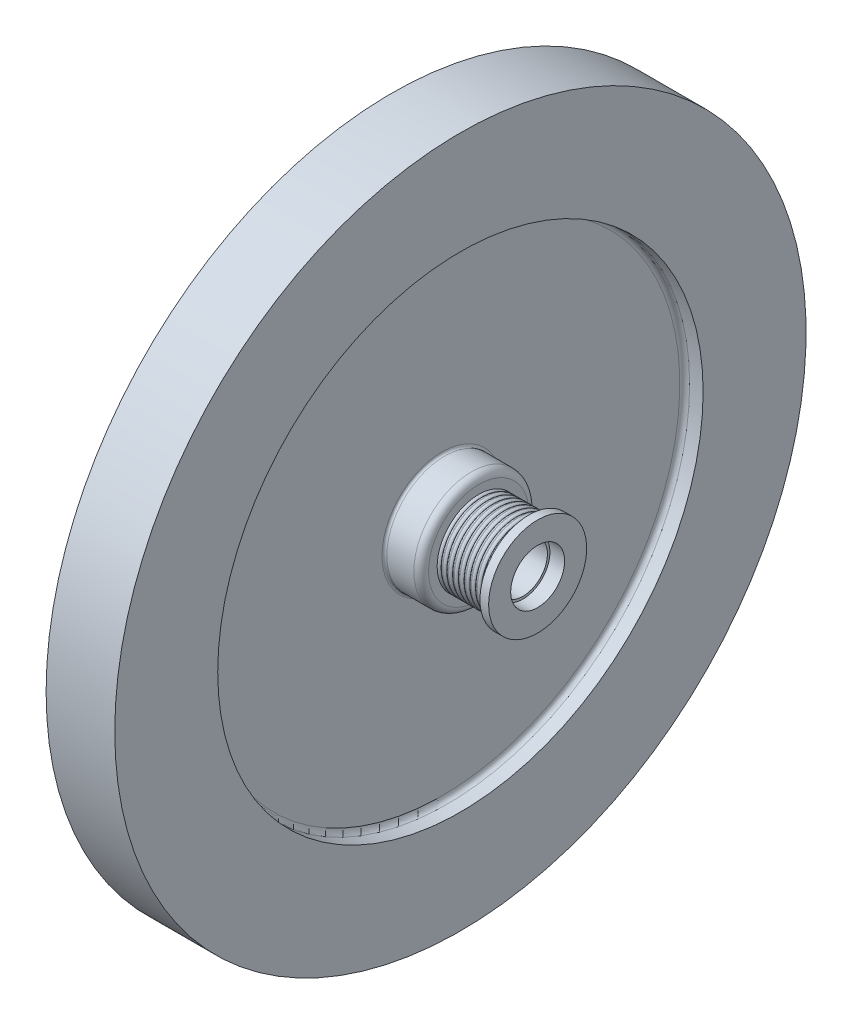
ISO-10303-21;
HEADER;
FILE_DESCRIPTION(('STEP AP214'),'2;1');
FILE_NAME('part.step','',(''),(''),'','','');
FILE_SCHEMA(('AUTOMOTIVE_DESIGN { 1 0 10303 214 1 1 1 1 }'));
ENDSEC;
DATA;
#1=APPLICATION_CONTEXT('core data for automotive mechanical design processes');
#2=APPLICATION_PROTOCOL_DEFINITION('international standard','automotive_design',2000,#1);
#3=PRODUCT_CONTEXT('',#1,'mechanical');
#4=PRODUCT('Part','Part','',(#3));
#5=PRODUCT_RELATED_PRODUCT_CATEGORY('part','',(#4));
#6=PRODUCT_DEFINITION_FORMATION('','',#4);
#7=PRODUCT_DEFINITION_CONTEXT('part definition',#1,'design');
#8=PRODUCT_DEFINITION('design','',#6,#7);
#9=PRODUCT_DEFINITION_SHAPE('','',#8);
#10=(LENGTH_UNIT() NAMED_UNIT(*) SI_UNIT(.MILLI.,.METRE.));
#11=(NAMED_UNIT(*) PLANE_ANGLE_UNIT() SI_UNIT($,.RADIAN.));
#12=(NAMED_UNIT(*) SI_UNIT($,.STERADIAN.) SOLID_ANGLE_UNIT());
#13=UNCERTAINTY_MEASURE_WITH_UNIT(LENGTH_MEASURE(1.E-05),#10,'distance_accuracy_value','');
#14=(GEOMETRIC_REPRESENTATION_CONTEXT(3) GLOBAL_UNCERTAINTY_ASSIGNED_CONTEXT((#13)) GLOBAL_UNIT_ASSIGNED_CONTEXT((#10,
#11,#12)) REPRESENTATION_CONTEXT('',''));
#15=CARTESIAN_POINT('',(0.,0.,0.));
#16=DIRECTION('',(0.,0.,1.));
#17=DIRECTION('',(1.,0.,0.));
#18=AXIS2_PLACEMENT_3D('',#15,#16,#17);
#19=CARTESIAN_POINT('',(454.339584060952,237.333609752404,0.));
#20=DIRECTION('',(-1.,0.,0.));
#21=DIRECTION('',(0.,0.,1.));
#22=AXIS2_PLACEMENT_3D('',#19,#20,#21);
#23=TOROIDAL_SURFACE('',#22,20.5,3.);
#24=CARTESIAN_POINT('',(454.339584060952,237.333609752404,0.));
#25=DIRECTION('',(-1.,0.,0.));
#26=DIRECTION('',(0.,0.,1.));
#27=AXIS2_PLACEMENT_3D('',#24,#25,#26);
#28=CIRCLE('',#27,23.5);
#29=CARTESIAN_POINT('',(454.339584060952,237.333609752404,23.5));
#30=VERTEX_POINT('',#29);
#31=EDGE_CURVE('E10',#30,#30,#28,.T.);
#32=ORIENTED_EDGE('',*,*,#31,.T.);
#33=EDGE_LOOP('',(#32));
#34=FACE_BOUND('',#33,.T.);
#35=CARTESIAN_POINT('',(451.339584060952,237.333609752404,0.));
#36=DIRECTION('',(-1.,0.,0.));
#37=DIRECTION('',(0.,0.,1.));
#38=AXIS2_PLACEMENT_3D('',#35,#36,#37);
#39=CIRCLE('',#38,20.5);
#40=CARTESIAN_POINT('',(451.339584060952,237.333609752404,20.5));
#41=VERTEX_POINT('',#40);
#42=EDGE_CURVE('E169',#41,#41,#39,.T.);
#43=ORIENTED_EDGE('',*,*,#42,.F.);
#44=EDGE_LOOP('',(#43));
#45=FACE_BOUND('',#44,.T.);
#46=ADVANCED_FACE('F15',(#34,#45),#23,.T.);
#47=CARTESIAN_POINT('',(437.512326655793,237.333609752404,0.));
#48=DIRECTION('',(-1.,0.,0.));
#49=DIRECTION('',(0.,0.,1.));
#50=AXIS2_PLACEMENT_3D('',#47,#48,#49);
#51=CYLINDRICAL_SURFACE('',#50,23.5);
#52=ORIENTED_EDGE('',*,*,#31,.F.);
#53=EDGE_LOOP('',(#52));
#54=FACE_BOUND('',#53,.T.);
#55=CARTESIAN_POINT('',(470.839584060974,237.333609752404,0.));
#56=DIRECTION('',(-1.,0.,0.));
#57=DIRECTION('',(0.,0.,1.));
#58=AXIS2_PLACEMENT_3D('',#55,#56,#57);
#59=CIRCLE('',#58,23.5);
#60=CARTESIAN_POINT('',(470.839584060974,237.333609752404,23.5));
#61=VERTEX_POINT('',#60);
#62=EDGE_CURVE('E21',#61,#61,#59,.T.);
#63=ORIENTED_EDGE('',*,*,#62,.T.);
#64=EDGE_LOOP('',(#63));
#65=FACE_BOUND('',#64,.T.);
#66=ADVANCED_FACE('F628',(#54,#65),#51,.T.);
#67=CARTESIAN_POINT('',(470.839584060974,237.333609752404,0.));
#68=DIRECTION('',(-1.,0.,0.));
#69=DIRECTION('',(0.,0.,1.));
#70=AXIS2_PLACEMENT_3D('',#67,#68,#69);
#71=TOROIDAL_SURFACE('',#70,24.5,1.);
#72=ORIENTED_EDGE('',*,*,#62,.F.);
#73=EDGE_LOOP('',(#72));
#74=FACE_BOUND('',#73,.T.);
#75=CARTESIAN_POINT('',(471.839584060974,237.333609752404,0.));
#76=DIRECTION('',(-1.,0.,0.));
#77=DIRECTION('',(0.,0.,1.));
#78=AXIS2_PLACEMENT_3D('',#75,#76,#77);
#79=CIRCLE('',#78,24.4999999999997);
#80=CARTESIAN_POINT('',(471.839584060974,237.333609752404,24.4999999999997));
#81=VERTEX_POINT('',#80);
#82=EDGE_CURVE('E25',#81,#81,#79,.T.);
#83=ORIENTED_EDGE('',*,*,#82,.T.);
#84=EDGE_LOOP('',(#83));
#85=FACE_BOUND('',#84,.T.);
#86=ADVANCED_FACE('F625',(#74,#85),#71,.F.);
#87=CARTESIAN_POINT('',(471.839584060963,312.833609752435,0.));
#88=DIRECTION('',(1.,0.,0.));
#89=DIRECTION('',(0.,0.,-1.));
#90=AXIS2_PLACEMENT_3D('',#87,#88,#89);
#91=PLANE('',#90);
#92=ORIENTED_EDGE('',*,*,#82,.F.);
#93=EDGE_LOOP('',(#92));
#94=FACE_BOUND('',#93,.T.);
#95=CARTESIAN_POINT('',(471.839584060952,237.333609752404,0.));
#96=DIRECTION('',(-1.,0.,0.));
#97=DIRECTION('',(0.,0.,1.));
#98=AXIS2_PLACEMENT_3D('',#95,#96,#97);
#99=CIRCLE('',#98,96.9999999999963);
#100=CARTESIAN_POINT('',(471.839584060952,237.333609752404,96.9999999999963));
#101=VERTEX_POINT('',#100);
#102=EDGE_CURVE('E29',#101,#101,#99,.T.);
#103=ORIENTED_EDGE('',*,*,#102,.T.);
#104=EDGE_LOOP('',(#103));
#105=FACE_BOUND('',#104,.T.);
#106=ADVANCED_FACE('F621',(#94,#105),#91,.F.);
#107=CARTESIAN_POINT('',(469.839584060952,237.333609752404,0.));
#108=DIRECTION('',(-1.,0.,0.));
#109=DIRECTION('',(0.,0.,1.));
#110=AXIS2_PLACEMENT_3D('',#107,#108,#109);
#111=TOROIDAL_SURFACE('',#110,96.9999999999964,2.);
#112=ORIENTED_EDGE('',*,*,#102,.F.);
#113=EDGE_LOOP('',(#112));
#114=FACE_BOUND('',#113,.T.);
#115=CARTESIAN_POINT('',(469.839584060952,237.333609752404,0.));
#116=DIRECTION('',(-1.,0.,0.));
#117=DIRECTION('',(0.,0.,1.));
#118=AXIS2_PLACEMENT_3D('',#115,#116,#117);
#119=CIRCLE('',#118,98.9999999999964);
#120=CARTESIAN_POINT('',(469.839584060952,237.333609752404,98.9999999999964));
#121=VERTEX_POINT('',#120);
#122=EDGE_CURVE('E34',#121,#121,#119,.T.);
#123=ORIENTED_EDGE('',*,*,#122,.T.);
#124=EDGE_LOOP('',(#123));
#125=FACE_BOUND('',#124,.T.);
#126=ADVANCED_FACE('F617',(#114,#125),#111,.F.);
#127=CARTESIAN_POINT('',(437.512326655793,237.333609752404,0.));
#128=DIRECTION('',(-1.,0.,0.));
#129=DIRECTION('',(0.,0.,1.));
#130=AXIS2_PLACEMENT_3D('',#127,#128,#129);
#131=CYLINDRICAL_SURFACE('',#130,98.9999999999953);
#132=CARTESIAN_POINT('',(463.339584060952,237.333609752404,0.));
#133=DIRECTION('',(-1.,0.,0.));
#134=DIRECTION('',(0.,0.,1.));
#135=AXIS2_PLACEMENT_3D('',#132,#133,#134);
#136=CIRCLE('',#135,98.9999999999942);
#137=CARTESIAN_POINT('',(463.339584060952,237.333609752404,98.9999999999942));
#138=VERTEX_POINT('',#137);
#139=EDGE_CURVE('E37',#138,#138,#136,.T.);
#140=ORIENTED_EDGE('',*,*,#139,.T.);
#141=EDGE_LOOP('',(#140));
#142=FACE_BOUND('',#141,.T.);
#143=ORIENTED_EDGE('',*,*,#122,.F.);
#144=EDGE_LOOP('',(#143));
#145=FACE_BOUND('',#144,.T.);
#146=ADVANCED_FACE('F613',(#142,#145),#131,.F.);
#147=CARTESIAN_POINT('',(463.339584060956,312.833609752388,0.));
#148=DIRECTION('',(-1.,0.,0.));
#149=DIRECTION('',(0.,0.,1.));
#150=AXIS2_PLACEMENT_3D('',#147,#148,#149);
#151=PLANE('',#150);
#152=CARTESIAN_POINT('',(463.339584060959,237.333609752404,0.));
#153=DIRECTION('',(-1.,0.,0.));
#154=DIRECTION('',(0.,0.,1.));
#155=AXIS2_PLACEMENT_3D('',#152,#153,#154);
#156=CIRCLE('',#155,141.);
#157=CARTESIAN_POINT('',(463.339584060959,237.333609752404,141.));
#158=VERTEX_POINT('',#157);
#159=EDGE_CURVE('E40',#158,#158,#156,.T.);
#160=ORIENTED_EDGE('',*,*,#159,.T.);
#161=EDGE_LOOP('',(#160));
#162=FACE_BOUND('',#161,.T.);
#163=ORIENTED_EDGE('',*,*,#139,.F.);
#164=EDGE_LOOP('',(#163));
#165=FACE_BOUND('',#164,.T.);
#166=ADVANCED_FACE('F609',(#162,#165),#151,.T.);
#167=CARTESIAN_POINT('',(437.512326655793,237.333609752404,0.));
#168=DIRECTION('',(-1.,0.,0.));
#169=DIRECTION('',(0.,0.,1.));
#170=AXIS2_PLACEMENT_3D('',#167,#168,#169);
#171=CYLINDRICAL_SURFACE('',#170,141.);
#172=ORIENTED_EDGE('',*,*,#159,.F.);
#173=EDGE_LOOP('',(#172));
#174=FACE_BOUND('',#173,.T.);
#175=CARTESIAN_POINT('',(491.339584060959,237.333609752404,0.));
#176=DIRECTION('',(-1.,0.,0.));
#177=DIRECTION('',(0.,0.,1.));
#178=AXIS2_PLACEMENT_3D('',#175,#176,#177);
#179=CIRCLE('',#178,141.000000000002);
#180=CARTESIAN_POINT('',(491.339584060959,237.333609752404,141.000000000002));
#181=VERTEX_POINT('',#180);
#182=EDGE_CURVE('E43',#181,#181,#179,.T.);
#183=ORIENTED_EDGE('',*,*,#182,.T.);
#184=EDGE_LOOP('',(#183));
#185=FACE_BOUND('',#184,.T.);
#186=ADVANCED_FACE('F605',(#174,#185),#171,.T.);
#187=CARTESIAN_POINT('',(491.339584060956,312.833609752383,0.));
#188=DIRECTION('',(-1.,0.,0.));
#189=DIRECTION('',(0.,0.,1.));
#190=AXIS2_PLACEMENT_3D('',#187,#188,#189);
#191=PLANE('',#190);
#192=ORIENTED_EDGE('',*,*,#182,.F.);
#193=EDGE_LOOP('',(#192));
#194=FACE_BOUND('',#193,.T.);
#195=CARTESIAN_POINT('',(491.339584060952,237.333609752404,0.));
#196=DIRECTION('',(-1.,0.,0.));
#197=DIRECTION('',(0.,0.,1.));
#198=AXIS2_PLACEMENT_3D('',#195,#196,#197);
#199=CIRCLE('',#198,98.9999999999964);
#200=CARTESIAN_POINT('',(491.339584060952,237.333609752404,98.9999999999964));
#201=VERTEX_POINT('',#200);
#202=EDGE_CURVE('E46',#201,#201,#199,.T.);
#203=ORIENTED_EDGE('',*,*,#202,.T.);
#204=EDGE_LOOP('',(#203));
#205=FACE_BOUND('',#204,.T.);
#206=ADVANCED_FACE('F601',(#194,#205),#191,.F.);
#207=CARTESIAN_POINT('',(437.512326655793,237.333609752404,0.));
#208=DIRECTION('',(-1.,0.,0.));
#209=DIRECTION('',(0.,0.,1.));
#210=AXIS2_PLACEMENT_3D('',#207,#208,#209);
#211=CYLINDRICAL_SURFACE('',#210,98.9999999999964);
#212=CARTESIAN_POINT('',(485.839584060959,237.333609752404,0.));
#213=DIRECTION('',(-1.,0.,0.));
#214=DIRECTION('',(0.,0.,1.));
#215=AXIS2_PLACEMENT_3D('',#212,#213,#214);
#216=CIRCLE('',#215,98.9999999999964);
#217=CARTESIAN_POINT('',(485.839584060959,237.333609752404,98.9999999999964));
#218=VERTEX_POINT('',#217);
#219=EDGE_CURVE('E49',#218,#218,#216,.T.);
#220=ORIENTED_EDGE('',*,*,#219,.T.);
#221=EDGE_LOOP('',(#220));
#222=FACE_BOUND('',#221,.T.);
#223=ORIENTED_EDGE('',*,*,#202,.F.);
#224=EDGE_LOOP('',(#223));
#225=FACE_BOUND('',#224,.T.);
#226=ADVANCED_FACE('F597',(#222,#225),#211,.F.);
#227=CARTESIAN_POINT('',(485.839584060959,237.333609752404,0.));
#228=DIRECTION('',(-1.,0.,0.));
#229=DIRECTION('',(0.,0.,1.));
#230=AXIS2_PLACEMENT_3D('',#227,#228,#229);
#231=TOROIDAL_SURFACE('',#230,96.9999999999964,2.);
#232=ORIENTED_EDGE('',*,*,#219,.F.);
#233=EDGE_LOOP('',(#232));
#234=FACE_BOUND('',#233,.T.);
#235=CARTESIAN_POINT('',(483.839584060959,237.333609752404,0.));
#236=DIRECTION('',(-1.,0.,0.));
#237=DIRECTION('',(0.,0.,1.));
#238=AXIS2_PLACEMENT_3D('',#235,#236,#237);
#239=CIRCLE('',#238,96.9999999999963);
#240=CARTESIAN_POINT('',(483.839584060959,237.333609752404,96.9999999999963));
#241=VERTEX_POINT('',#240);
#242=EDGE_CURVE('E52',#241,#241,#239,.T.);
#243=ORIENTED_EDGE('',*,*,#242,.T.);
#244=EDGE_LOOP('',(#243));
#245=FACE_BOUND('',#244,.T.);
#246=ADVANCED_FACE('F593',(#234,#245),#231,.F.);
#247=CARTESIAN_POINT('',(483.839584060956,312.833609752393,0.));
#248=DIRECTION('',(1.,0.,0.));
#249=DIRECTION('',(0.,0.,-1.));
#250=AXIS2_PLACEMENT_3D('',#247,#248,#249);
#251=PLANE('',#250);
#252=CARTESIAN_POINT('',(483.839584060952,237.333609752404,0.));
#253=DIRECTION('',(-1.,0.,0.));
#254=DIRECTION('',(0.,0.,1.));
#255=AXIS2_PLACEMENT_3D('',#252,#253,#254);
#256=CIRCLE('',#255,24.4999999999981);
#257=CARTESIAN_POINT('',(483.839584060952,237.333609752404,24.4999999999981));
#258=VERTEX_POINT('',#257);
#259=EDGE_CURVE('E55',#258,#258,#256,.T.);
#260=ORIENTED_EDGE('',*,*,#259,.T.);
#261=EDGE_LOOP('',(#260));
#262=FACE_BOUND('',#261,.T.);
#263=ORIENTED_EDGE('',*,*,#242,.F.);
#264=EDGE_LOOP('',(#263));
#265=FACE_BOUND('',#264,.T.);
#266=ADVANCED_FACE('F589',(#262,#265),#251,.T.);
#267=CARTESIAN_POINT('',(484.839584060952,237.333609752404,0.));
#268=DIRECTION('',(-1.,0.,0.));
#269=DIRECTION('',(0.,0.,1.));
#270=AXIS2_PLACEMENT_3D('',#267,#268,#269);
#271=TOROIDAL_SURFACE('',#270,24.4999999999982,1.);
#272=ORIENTED_EDGE('',*,*,#259,.F.);
#273=EDGE_LOOP('',(#272));
#274=FACE_BOUND('',#273,.T.);
#275=CARTESIAN_POINT('',(484.839584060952,237.333609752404,0.));
#276=DIRECTION('',(-1.,0.,0.));
#277=DIRECTION('',(0.,0.,1.));
#278=AXIS2_PLACEMENT_3D('',#275,#276,#277);
#279=CIRCLE('',#278,23.4999999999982);
#280=CARTESIAN_POINT('',(484.839584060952,237.333609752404,23.4999999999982));
#281=VERTEX_POINT('',#280);
#282=EDGE_CURVE('E58',#281,#281,#279,.T.);
#283=ORIENTED_EDGE('',*,*,#282,.T.);
#284=EDGE_LOOP('',(#283));
#285=FACE_BOUND('',#284,.T.);
#286=ADVANCED_FACE('F585',(#274,#285),#271,.F.);
#287=CARTESIAN_POINT('',(437.512326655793,237.333609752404,0.));
#288=DIRECTION('',(-1.,0.,0.));
#289=DIRECTION('',(0.,0.,1.));
#290=AXIS2_PLACEMENT_3D('',#287,#288,#289);
#291=CYLINDRICAL_SURFACE('',#290,23.4999999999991);
#292=ORIENTED_EDGE('',*,*,#282,.F.);
#293=EDGE_LOOP('',(#292));
#294=FACE_BOUND('',#293,.T.);
#295=CARTESIAN_POINT('',(495.839584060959,237.333609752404,0.));
#296=DIRECTION('',(-1.,0.,0.));
#297=DIRECTION('',(0.,0.,1.));
#298=AXIS2_PLACEMENT_3D('',#295,#296,#297);
#299=CIRCLE('',#298,23.5);
#300=CARTESIAN_POINT('',(495.839584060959,237.333609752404,23.5));
#301=VERTEX_POINT('',#300);
#302=EDGE_CURVE('E61',#301,#301,#299,.T.);
#303=ORIENTED_EDGE('',*,*,#302,.T.);
#304=EDGE_LOOP('',(#303));
#305=FACE_BOUND('',#304,.T.);
#306=ADVANCED_FACE('F581',(#294,#305),#291,.T.);
#307=CARTESIAN_POINT('',(495.839584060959,237.333609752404,0.));
#308=DIRECTION('',(-1.,0.,0.));
#309=DIRECTION('',(0.,0.,1.));
#310=AXIS2_PLACEMENT_3D('',#307,#308,#309);
#311=TOROIDAL_SURFACE('',#310,20.5,3.);
#312=CARTESIAN_POINT('',(498.839584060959,237.333609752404,0.));
#313=DIRECTION('',(-1.,0.,0.));
#314=DIRECTION('',(0.,0.,1.));
#315=AXIS2_PLACEMENT_3D('',#312,#313,#314);
#316=CIRCLE('',#315,20.4999999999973);
#317=CARTESIAN_POINT('',(498.839584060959,237.333609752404,20.4999999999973));
#318=VERTEX_POINT('',#317);
#319=EDGE_CURVE('E64',#318,#318,#316,.T.);
#320=ORIENTED_EDGE('',*,*,#319,.T.);
#321=EDGE_LOOP('',(#320));
#322=FACE_BOUND('',#321,.T.);
#323=ORIENTED_EDGE('',*,*,#302,.F.);
#324=EDGE_LOOP('',(#323));
#325=FACE_BOUND('',#324,.T.);
#326=ADVANCED_FACE('F577',(#322,#325),#311,.T.);
#327=CARTESIAN_POINT('',(498.839584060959,312.833609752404,0.));
#328=DIRECTION('',(1.,0.,0.));
#329=DIRECTION('',(0.,0.,-1.));
#330=AXIS2_PLACEMENT_3D('',#327,#328,#329);
#331=PLANE('',#330);
#332=CARTESIAN_POINT('',(498.839584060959,237.333609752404,0.));
#333=DIRECTION('',(-1.,0.,0.));
#334=DIRECTION('',(0.,0.,1.));
#335=AXIS2_PLACEMENT_3D('',#332,#333,#334);
#336=CIRCLE('',#335,16.9996112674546);
#337=CARTESIAN_POINT('',(498.839584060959,237.333609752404,16.9996112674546));
#338=VERTEX_POINT('',#337);
#339=EDGE_CURVE('E67',#338,#338,#336,.T.);
#340=ORIENTED_EDGE('',*,*,#339,.T.);
#341=EDGE_LOOP('',(#340));
#342=FACE_BOUND('',#341,.T.);
#343=ORIENTED_EDGE('',*,*,#319,.F.);
#344=EDGE_LOOP('',(#343));
#345=FACE_BOUND('',#344,.T.);
#346=ADVANCED_FACE('F573',(#342,#345),#331,.T.);
#347=CARTESIAN_POINT('',(498.809042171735,237.333609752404,0.));
#348=DIRECTION('',(-1.,0.,0.));
#349=DIRECTION('',(0.,0.,1.));
#350=AXIS2_PLACEMENT_3D('',#347,#348,#349);
#351=TOROIDAL_SURFACE('',#350,15.7999999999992,1.20000000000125);
#352=CARTESIAN_POINT('',(499.884313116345,237.333609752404,0.));
#353=DIRECTION('',(-1.,0.,0.));
#354=DIRECTION('',(0.,0.,1.));
#355=AXIS2_PLACEMENT_3D('',#352,#353,#354);
#356=CIRCLE('',#355,16.3327216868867);
#357=CARTESIAN_POINT('',(499.884313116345,237.333609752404,16.3327216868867));
#358=VERTEX_POINT('',#357);
#359=EDGE_CURVE('E70',#358,#358,#356,.T.);
#360=ORIENTED_EDGE('',*,*,#359,.T.);
#361=EDGE_LOOP('',(#360));
#362=FACE_BOUND('',#361,.T.);
#363=ORIENTED_EDGE('',*,*,#339,.F.);
#364=EDGE_LOOP('',(#363));
#365=FACE_BOUND('',#364,.T.);
#366=ADVANCED_FACE('F569',(#362,#365),#351,.T.);
#367=CARTESIAN_POINT('',(500.959584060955,237.333609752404,0.));
#368=DIRECTION('',(-1.,0.,0.));
#369=DIRECTION('',(0.,0.,1.));
#370=AXIS2_PLACEMENT_3D('',#367,#368,#369);
#371=TOROIDAL_SURFACE('',#370,15.7999999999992,1.20000000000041);
#372=CARTESIAN_POINT('',(500.959584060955,237.333609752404,0.));
#373=DIRECTION('',(-1.,0.,0.));
#374=DIRECTION('',(0.,0.,1.));
#375=AXIS2_PLACEMENT_3D('',#372,#373,#374);
#376=CIRCLE('',#375,16.9999999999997);
#377=CARTESIAN_POINT('',(500.959584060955,237.333609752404,16.9999999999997));
#378=VERTEX_POINT('',#377);
#379=EDGE_CURVE('E73',#378,#378,#376,.T.);
#380=ORIENTED_EDGE('',*,*,#379,.T.);
#381=EDGE_LOOP('',(#380));
#382=FACE_BOUND('',#381,.T.);
#383=ORIENTED_EDGE('',*,*,#359,.F.);
#384=EDGE_LOOP('',(#383));
#385=FACE_BOUND('',#384,.T.);
#386=ADVANCED_FACE('F565',(#382,#385),#371,.T.);
#387=CARTESIAN_POINT('',(437.512326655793,237.333609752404,0.));
#388=DIRECTION('',(-1.,0.,0.));
#389=DIRECTION('',(0.,0.,1.));
#390=AXIS2_PLACEMENT_3D('',#387,#388,#389);
#391=CYLINDRICAL_SURFACE('',#390,16.9999999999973);
#392=ORIENTED_EDGE('',*,*,#379,.F.);
#393=EDGE_LOOP('',(#392));
#394=FACE_BOUND('',#393,.T.);
#395=CARTESIAN_POINT('',(501.149042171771,237.333609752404,0.));
#396=DIRECTION('',(-1.,0.,0.));
#397=DIRECTION('',(0.,0.,1.));
#398=AXIS2_PLACEMENT_3D('',#395,#396,#397);
#399=CIRCLE('',#398,16.999999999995);
#400=CARTESIAN_POINT('',(501.149042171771,237.333609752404,16.999999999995));
#401=VERTEX_POINT('',#400);
#402=EDGE_CURVE('E76',#401,#401,#399,.T.);
#403=ORIENTED_EDGE('',*,*,#402,.T.);
#404=EDGE_LOOP('',(#403));
#405=FACE_BOUND('',#404,.T.);
#406=ADVANCED_FACE('F561',(#394,#405),#391,.T.);
#407=CARTESIAN_POINT('',(501.149042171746,237.333609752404,0.));
#408=DIRECTION('',(-1.,0.,0.));
#409=DIRECTION('',(0.,0.,1.));
#410=AXIS2_PLACEMENT_3D('',#407,#408,#409);
#411=TOROIDAL_SURFACE('',#410,15.7999999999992,1.19999999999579);
#412=CARTESIAN_POINT('',(502.224313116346,237.333609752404,0.));
#413=DIRECTION('',(-1.,0.,0.));
#414=DIRECTION('',(0.,0.,1.));
#415=AXIS2_PLACEMENT_3D('',#412,#413,#414);
#416=CIRCLE('',#415,16.3327216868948);
#417=CARTESIAN_POINT('',(502.224313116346,237.333609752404,16.3327216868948));
#418=VERTEX_POINT('',#417);
#419=EDGE_CURVE('E79',#418,#418,#416,.T.);
#420=ORIENTED_EDGE('',*,*,#419,.T.);
#421=EDGE_LOOP('',(#420));
#422=FACE_BOUND('',#421,.T.);
#423=ORIENTED_EDGE('',*,*,#402,.F.);
#424=EDGE_LOOP('',(#423));
#425=FACE_BOUND('',#424,.T.);
#426=ADVANCED_FACE('F557',(#422,#425),#411,.T.);
#427=CARTESIAN_POINT('',(503.299584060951,237.333609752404,0.));
#428=DIRECTION('',(-1.,0.,0.));
#429=DIRECTION('',(0.,0.,1.));
#430=AXIS2_PLACEMENT_3D('',#427,#428,#429);
#431=TOROIDAL_SURFACE('',#430,15.7999999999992,1.19999999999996);
#432=CARTESIAN_POINT('',(503.299584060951,237.333609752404,0.));
#433=DIRECTION('',(-1.,0.,0.));
#434=DIRECTION('',(0.,0.,1.));
#435=AXIS2_PLACEMENT_3D('',#432,#433,#434);
#436=CIRCLE('',#435,16.9999999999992);
#437=CARTESIAN_POINT('',(503.299584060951,237.333609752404,16.9999999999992));
#438=VERTEX_POINT('',#437);
#439=EDGE_CURVE('E82',#438,#438,#436,.T.);
#440=ORIENTED_EDGE('',*,*,#439,.T.);
#441=EDGE_LOOP('',(#440));
#442=FACE_BOUND('',#441,.T.);
#443=ORIENTED_EDGE('',*,*,#419,.F.);
#444=EDGE_LOOP('',(#443));
#445=FACE_BOUND('',#444,.T.);
#446=ADVANCED_FACE('F553',(#442,#445),#431,.T.);
#447=CARTESIAN_POINT('',(437.512326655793,237.333609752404,0.));
#448=DIRECTION('',(-1.,0.,0.));
#449=DIRECTION('',(0.,0.,1.));
#450=AXIS2_PLACEMENT_3D('',#447,#448,#449);
#451=CYLINDRICAL_SURFACE('',#450,16.9999999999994);
#452=ORIENTED_EDGE('',*,*,#439,.F.);
#453=EDGE_LOOP('',(#452));
#454=FACE_BOUND('',#453,.T.);
#455=CARTESIAN_POINT('',(503.48904217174,237.333609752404,0.));
#456=DIRECTION('',(-1.,0.,0.));
#457=DIRECTION('',(0.,0.,1.));
#458=AXIS2_PLACEMENT_3D('',#455,#456,#457);
#459=CIRCLE('',#458,16.9999999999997);
#460=CARTESIAN_POINT('',(503.48904217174,237.333609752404,16.9999999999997));
#461=VERTEX_POINT('',#460);
#462=EDGE_CURVE('E85',#461,#461,#459,.T.);
#463=ORIENTED_EDGE('',*,*,#462,.T.);
#464=EDGE_LOOP('',(#463));
#465=FACE_BOUND('',#464,.T.);
#466=ADVANCED_FACE('F549',(#454,#465),#451,.T.);
#467=CARTESIAN_POINT('',(503.489042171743,237.333609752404,0.));
#468=DIRECTION('',(-1.,0.,0.));
#469=DIRECTION('',(0.,0.,1.));
#470=AXIS2_PLACEMENT_3D('',#467,#468,#469);
#471=TOROIDAL_SURFACE('',#470,15.7999999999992,1.20000000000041);
#472=CARTESIAN_POINT('',(504.564313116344,237.333609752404,0.));
#473=DIRECTION('',(-1.,0.,0.));
#474=DIRECTION('',(0.,0.,1.));
#475=AXIS2_PLACEMENT_3D('',#472,#473,#474);
#476=CIRCLE('',#475,16.3327216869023);
#477=CARTESIAN_POINT('',(504.564313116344,237.333609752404,16.3327216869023));
#478=VERTEX_POINT('',#477);
#479=EDGE_CURVE('E88',#478,#478,#476,.T.);
#480=ORIENTED_EDGE('',*,*,#479,.T.);
#481=EDGE_LOOP('',(#480));
#482=FACE_BOUND('',#481,.T.);
#483=ORIENTED_EDGE('',*,*,#462,.F.);
#484=EDGE_LOOP('',(#483));
#485=FACE_BOUND('',#484,.T.);
#486=ADVANCED_FACE('F545',(#482,#485),#471,.T.);
#487=CARTESIAN_POINT('',(505.639584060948,237.333609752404,0.));
#488=DIRECTION('',(-1.,0.,0.));
#489=DIRECTION('',(0.,0.,1.));
#490=AXIS2_PLACEMENT_3D('',#487,#488,#489);
#491=TOROIDAL_SURFACE('',#490,15.7999999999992,1.20000000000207);
#492=CARTESIAN_POINT('',(505.639584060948,237.333609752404,0.));
#493=DIRECTION('',(-1.,0.,0.));
#494=DIRECTION('',(0.,0.,1.));
#495=AXIS2_PLACEMENT_3D('',#492,#493,#494);
#496=CIRCLE('',#495,17.0000000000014);
#497=CARTESIAN_POINT('',(505.639584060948,237.333609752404,17.0000000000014));
#498=VERTEX_POINT('',#497);
#499=EDGE_CURVE('E91',#498,#498,#496,.T.);
#500=ORIENTED_EDGE('',*,*,#499,.T.);
#501=EDGE_LOOP('',(#500));
#502=FACE_BOUND('',#501,.T.);
#503=ORIENTED_EDGE('',*,*,#479,.F.);
#504=EDGE_LOOP('',(#503));
#505=FACE_BOUND('',#504,.T.);
#506=ADVANCED_FACE('F541',(#502,#505),#491,.T.);
#507=CARTESIAN_POINT('',(437.512326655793,237.333609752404,0.));
#508=DIRECTION('',(-1.,0.,0.));
#509=DIRECTION('',(0.,0.,1.));
#510=AXIS2_PLACEMENT_3D('',#507,#508,#509);
#511=CYLINDRICAL_SURFACE('',#510,17.);
#512=ORIENTED_EDGE('',*,*,#499,.F.);
#513=EDGE_LOOP('',(#512));
#514=FACE_BOUND('',#513,.T.);
#515=CARTESIAN_POINT('',(505.829042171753,237.333609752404,0.));
#516=DIRECTION('',(-1.,0.,0.));
#517=DIRECTION('',(0.,0.,1.));
#518=AXIS2_PLACEMENT_3D('',#515,#516,#517);
#519=CIRCLE('',#518,16.9999999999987);
#520=CARTESIAN_POINT('',(505.829042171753,237.333609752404,16.9999999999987));
#521=VERTEX_POINT('',#520);
#522=EDGE_CURVE('E94',#521,#521,#519,.T.);
#523=ORIENTED_EDGE('',*,*,#522,.T.);
#524=EDGE_LOOP('',(#523));
#525=FACE_BOUND('',#524,.T.);
#526=ADVANCED_FACE('F537',(#514,#525),#511,.T.);
#527=CARTESIAN_POINT('',(505.829042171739,237.333609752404,0.));
#528=DIRECTION('',(-1.,0.,0.));
#529=DIRECTION('',(0.,0.,1.));
#530=AXIS2_PLACEMENT_3D('',#527,#528,#529);
#531=TOROIDAL_SURFACE('',#530,15.7999999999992,1.19999999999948);
#532=CARTESIAN_POINT('',(506.904313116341,237.333609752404,0.));
#533=DIRECTION('',(-1.,0.,0.));
#534=DIRECTION('',(0.,0.,1.));
#535=AXIS2_PLACEMENT_3D('',#532,#533,#534);
#536=CIRCLE('',#535,16.332721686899);
#537=CARTESIAN_POINT('',(506.904313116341,237.333609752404,16.332721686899));
#538=VERTEX_POINT('',#537);
#539=EDGE_CURVE('E97',#538,#538,#536,.T.);
#540=ORIENTED_EDGE('',*,*,#539,.T.);
#541=EDGE_LOOP('',(#540));
#542=FACE_BOUND('',#541,.T.);
#543=ORIENTED_EDGE('',*,*,#522,.F.);
#544=EDGE_LOOP('',(#543));
#545=FACE_BOUND('',#544,.T.);
#546=ADVANCED_FACE('F533',(#542,#545),#531,.T.);
#547=CARTESIAN_POINT('',(507.979584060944,237.333609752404,0.));
#548=DIRECTION('',(-1.,0.,0.));
#549=DIRECTION('',(0.,0.,1.));
#550=AXIS2_PLACEMENT_3D('',#547,#548,#549);
#551=TOROIDAL_SURFACE('',#550,15.7999999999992,1.19999999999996);
#552=CARTESIAN_POINT('',(507.979584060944,237.333609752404,0.));
#553=DIRECTION('',(-1.,0.,0.));
#554=DIRECTION('',(0.,0.,1.));
#555=AXIS2_PLACEMENT_3D('',#552,#553,#554);
#556=CIRCLE('',#555,16.9999999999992);
#557=CARTESIAN_POINT('',(507.979584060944,237.333609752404,16.9999999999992));
#558=VERTEX_POINT('',#557);
#559=EDGE_CURVE('E100',#558,#558,#556,.T.);
#560=ORIENTED_EDGE('',*,*,#559,.T.);
#561=EDGE_LOOP('',(#560));
#562=FACE_BOUND('',#561,.T.);
#563=ORIENTED_EDGE('',*,*,#539,.F.);
#564=EDGE_LOOP('',(#563));
#565=FACE_BOUND('',#564,.T.);
#566=ADVANCED_FACE('F529',(#562,#565),#551,.T.);
#567=CARTESIAN_POINT('',(437.512326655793,237.333609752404,0.));
#568=DIRECTION('',(-1.,0.,0.));
#569=DIRECTION('',(0.,0.,1.));
#570=AXIS2_PLACEMENT_3D('',#567,#568,#569);
#571=CYLINDRICAL_SURFACE('',#570,16.9999999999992);
#572=ORIENTED_EDGE('',*,*,#559,.F.);
#573=EDGE_LOOP('',(#572));
#574=FACE_BOUND('',#573,.T.);
#575=CARTESIAN_POINT('',(508.169042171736,237.333609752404,0.));
#576=DIRECTION('',(-1.,0.,0.));
#577=DIRECTION('',(0.,0.,1.));
#578=AXIS2_PLACEMENT_3D('',#575,#576,#577);
#579=CIRCLE('',#578,16.9999999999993);
#580=CARTESIAN_POINT('',(508.169042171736,237.333609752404,16.9999999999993));
#581=VERTEX_POINT('',#580);
#582=EDGE_CURVE('E103',#581,#581,#579,.T.);
#583=ORIENTED_EDGE('',*,*,#582,.T.);
#584=EDGE_LOOP('',(#583));
#585=FACE_BOUND('',#584,.T.);
#586=ADVANCED_FACE('F525',(#574,#585),#571,.T.);
#587=CARTESIAN_POINT('',(508.169042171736,237.333609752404,0.));
#588=DIRECTION('',(-1.,0.,0.));
#589=DIRECTION('',(0.,0.,1.));
#590=AXIS2_PLACEMENT_3D('',#587,#588,#589);
#591=TOROIDAL_SURFACE('',#590,15.7999999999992,1.20000000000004);
#592=CARTESIAN_POINT('',(509.244313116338,237.333609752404,0.));
#593=DIRECTION('',(-1.,0.,0.));
#594=DIRECTION('',(0.,0.,1.));
#595=AXIS2_PLACEMENT_3D('',#592,#593,#594);
#596=CIRCLE('',#595,16.3327216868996);
#597=CARTESIAN_POINT('',(509.244313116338,237.333609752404,16.3327216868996));
#598=VERTEX_POINT('',#597);
#599=EDGE_CURVE('E106',#598,#598,#596,.T.);
#600=ORIENTED_EDGE('',*,*,#599,.T.);
#601=EDGE_LOOP('',(#600));
#602=FACE_BOUND('',#601,.T.);
#603=ORIENTED_EDGE('',*,*,#582,.F.);
#604=EDGE_LOOP('',(#603));
#605=FACE_BOUND('',#604,.T.);
#606=ADVANCED_FACE('F521',(#602,#605),#591,.T.);
#607=CARTESIAN_POINT('',(510.319584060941,237.333609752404,0.));
#608=DIRECTION('',(-1.,0.,0.));
#609=DIRECTION('',(0.,0.,1.));
#610=AXIS2_PLACEMENT_3D('',#607,#608,#609);
#611=TOROIDAL_SURFACE('',#610,15.7999999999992,1.20000000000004);
#612=CARTESIAN_POINT('',(510.319584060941,237.333609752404,0.));
#613=DIRECTION('',(-1.,0.,0.));
#614=DIRECTION('',(0.,0.,1.));
#615=AXIS2_PLACEMENT_3D('',#612,#613,#614);
#616=CIRCLE('',#615,16.9999999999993);
#617=CARTESIAN_POINT('',(510.319584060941,237.333609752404,16.9999999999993));
#618=VERTEX_POINT('',#617);
#619=EDGE_CURVE('E109',#618,#618,#616,.T.);
#620=ORIENTED_EDGE('',*,*,#619,.T.);
#621=EDGE_LOOP('',(#620));
#622=FACE_BOUND('',#621,.T.);
#623=ORIENTED_EDGE('',*,*,#599,.F.);
#624=EDGE_LOOP('',(#623));
#625=FACE_BOUND('',#624,.T.);
#626=ADVANCED_FACE('F517',(#622,#625),#611,.T.);
#627=CARTESIAN_POINT('',(437.512326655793,237.333609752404,0.));
#628=DIRECTION('',(-1.,0.,0.));
#629=DIRECTION('',(0.,0.,1.));
#630=AXIS2_PLACEMENT_3D('',#627,#628,#629);
#631=CYLINDRICAL_SURFACE('',#630,16.9999999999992);
#632=ORIENTED_EDGE('',*,*,#619,.F.);
#633=EDGE_LOOP('',(#632));
#634=FACE_BOUND('',#633,.T.);
#635=CARTESIAN_POINT('',(510.509042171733,237.333609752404,0.));
#636=DIRECTION('',(-1.,0.,0.));
#637=DIRECTION('',(0.,0.,1.));
#638=AXIS2_PLACEMENT_3D('',#635,#636,#637);
#639=CIRCLE('',#638,16.9999999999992);
#640=CARTESIAN_POINT('',(510.509042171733,237.333609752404,16.9999999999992));
#641=VERTEX_POINT('',#640);
#642=EDGE_CURVE('E112',#641,#641,#639,.T.);
#643=ORIENTED_EDGE('',*,*,#642,.T.);
#644=EDGE_LOOP('',(#643));
#645=FACE_BOUND('',#644,.T.);
#646=ADVANCED_FACE('F513',(#634,#645),#631,.T.);
#647=CARTESIAN_POINT('',(510.509042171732,237.333609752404,0.));
#648=DIRECTION('',(-1.,0.,0.));
#649=DIRECTION('',(0.,0.,1.));
#650=AXIS2_PLACEMENT_3D('',#647,#648,#649);
#651=TOROIDAL_SURFACE('',#650,15.7999999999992,1.19999999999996);
#652=CARTESIAN_POINT('',(511.584313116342,237.333609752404,0.));
#653=DIRECTION('',(-1.,0.,0.));
#654=DIRECTION('',(0.,0.,1.));
#655=AXIS2_PLACEMENT_3D('',#652,#653,#654);
#656=CIRCLE('',#655,16.3327216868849);
#657=CARTESIAN_POINT('',(511.584313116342,237.333609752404,16.3327216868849));
#658=VERTEX_POINT('',#657);
#659=EDGE_CURVE('E115',#658,#658,#656,.T.);
#660=ORIENTED_EDGE('',*,*,#659,.T.);
#661=EDGE_LOOP('',(#660));
#662=FACE_BOUND('',#661,.T.);
#663=ORIENTED_EDGE('',*,*,#642,.F.);
#664=EDGE_LOOP('',(#663));
#665=FACE_BOUND('',#664,.T.);
#666=ADVANCED_FACE('F509',(#662,#665),#651,.T.);
#667=CARTESIAN_POINT('',(512.659584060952,237.333609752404,0.));
#668=DIRECTION('',(-1.,0.,0.));
#669=DIRECTION('',(0.,0.,1.));
#670=AXIS2_PLACEMENT_3D('',#667,#668,#669);
#671=TOROIDAL_SURFACE('',#670,15.7999999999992,1.19999999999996);
#672=CARTESIAN_POINT('',(512.659584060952,237.333609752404,0.));
#673=DIRECTION('',(-1.,0.,0.));
#674=DIRECTION('',(0.,0.,1.));
#675=AXIS2_PLACEMENT_3D('',#672,#673,#674);
#676=CIRCLE('',#675,16.9999999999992);
#677=CARTESIAN_POINT('',(512.659584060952,237.333609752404,16.9999999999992));
#678=VERTEX_POINT('',#677);
#679=EDGE_CURVE('E118',#678,#678,#676,.T.);
#680=ORIENTED_EDGE('',*,*,#679,.T.);
#681=EDGE_LOOP('',(#680));
#682=FACE_BOUND('',#681,.T.);
#683=ORIENTED_EDGE('',*,*,#659,.F.);
#684=EDGE_LOOP('',(#683));
#685=FACE_BOUND('',#684,.T.);
#686=ADVANCED_FACE('F505',(#682,#685),#671,.T.);
#687=CARTESIAN_POINT('',(437.512326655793,237.333609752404,0.));
#688=DIRECTION('',(-1.,0.,0.));
#689=DIRECTION('',(0.,0.,1.));
#690=AXIS2_PLACEMENT_3D('',#687,#688,#689);
#691=CYLINDRICAL_SURFACE('',#690,16.9999999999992);
#692=ORIENTED_EDGE('',*,*,#679,.F.);
#693=EDGE_LOOP('',(#692));
#694=FACE_BOUND('',#693,.T.);
#695=CARTESIAN_POINT('',(512.849042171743,237.333609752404,0.));
#696=DIRECTION('',(-1.,0.,0.));
#697=DIRECTION('',(0.,0.,1.));
#698=AXIS2_PLACEMENT_3D('',#695,#696,#697);
#699=CIRCLE('',#698,16.9999999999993);
#700=CARTESIAN_POINT('',(512.849042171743,237.333609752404,16.9999999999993));
#701=VERTEX_POINT('',#700);
#702=EDGE_CURVE('E121',#701,#701,#699,.T.);
#703=ORIENTED_EDGE('',*,*,#702,.T.);
#704=EDGE_LOOP('',(#703));
#705=FACE_BOUND('',#704,.T.);
#706=ADVANCED_FACE('F501',(#694,#705),#691,.T.);
#707=CARTESIAN_POINT('',(512.849042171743,237.333609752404,0.));
#708=DIRECTION('',(-1.,0.,0.));
#709=DIRECTION('',(0.,0.,1.));
#710=AXIS2_PLACEMENT_3D('',#707,#708,#709);
#711=TOROIDAL_SURFACE('',#710,15.7999999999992,1.20000000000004);
#712=CARTESIAN_POINT('',(513.924313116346,237.333609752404,0.));
#713=DIRECTION('',(-1.,0.,0.));
#714=DIRECTION('',(0.,0.,1.));
#715=AXIS2_PLACEMENT_3D('',#712,#713,#714);
#716=CIRCLE('',#715,16.3327216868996);
#717=CARTESIAN_POINT('',(513.924313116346,237.333609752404,16.3327216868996));
#718=VERTEX_POINT('',#717);
#719=EDGE_CURVE('E124',#718,#718,#716,.T.);
#720=ORIENTED_EDGE('',*,*,#719,.T.);
#721=EDGE_LOOP('',(#720));
#722=FACE_BOUND('',#721,.T.);
#723=ORIENTED_EDGE('',*,*,#702,.F.);
#724=EDGE_LOOP('',(#723));
#725=FACE_BOUND('',#724,.T.);
#726=ADVANCED_FACE('F497',(#722,#725),#711,.T.);
#727=CARTESIAN_POINT('',(514.999584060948,237.333609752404,0.));
#728=DIRECTION('',(-1.,0.,0.));
#729=DIRECTION('',(0.,0.,1.));
#730=AXIS2_PLACEMENT_3D('',#727,#728,#729);
#731=TOROIDAL_SURFACE('',#730,15.7999999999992,1.20000000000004);
#732=CARTESIAN_POINT('',(514.999584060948,237.333609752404,0.));
#733=DIRECTION('',(-1.,0.,0.));
#734=DIRECTION('',(0.,0.,1.));
#735=AXIS2_PLACEMENT_3D('',#732,#733,#734);
#736=CIRCLE('',#735,16.9999999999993);
#737=CARTESIAN_POINT('',(514.999584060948,237.333609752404,16.9999999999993));
#738=VERTEX_POINT('',#737);
#739=EDGE_CURVE('E127',#738,#738,#736,.T.);
#740=ORIENTED_EDGE('',*,*,#739,.T.);
#741=EDGE_LOOP('',(#740));
#742=FACE_BOUND('',#741,.T.);
#743=ORIENTED_EDGE('',*,*,#719,.F.);
#744=EDGE_LOOP('',(#743));
#745=FACE_BOUND('',#744,.T.);
#746=ADVANCED_FACE('F493',(#742,#745),#731,.T.);
#747=CARTESIAN_POINT('',(437.512326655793,237.333609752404,0.));
#748=DIRECTION('',(-1.,0.,0.));
#749=DIRECTION('',(0.,0.,1.));
#750=AXIS2_PLACEMENT_3D('',#747,#748,#749);
#751=CYLINDRICAL_SURFACE('',#750,17.0000000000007);
#752=ORIENTED_EDGE('',*,*,#739,.F.);
#753=EDGE_LOOP('',(#752));
#754=FACE_BOUND('',#753,.T.);
#755=CARTESIAN_POINT('',(515.189042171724,237.333609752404,0.));
#756=DIRECTION('',(-1.,0.,0.));
#757=DIRECTION('',(0.,0.,1.));
#758=AXIS2_PLACEMENT_3D('',#755,#756,#757);
#759=CIRCLE('',#758,17.0000000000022);
#760=CARTESIAN_POINT('',(515.189042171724,237.333609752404,17.0000000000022));
#761=VERTEX_POINT('',#760);
#762=EDGE_CURVE('E130',#761,#761,#759,.T.);
#763=ORIENTED_EDGE('',*,*,#762,.T.);
#764=EDGE_LOOP('',(#763));
#765=FACE_BOUND('',#764,.T.);
#766=ADVANCED_FACE('F489',(#754,#765),#751,.T.);
#767=CARTESIAN_POINT('',(515.18904217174,237.333609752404,0.));
#768=DIRECTION('',(-1.,0.,0.));
#769=DIRECTION('',(0.,0.,1.));
#770=AXIS2_PLACEMENT_3D('',#767,#768,#769);
#771=TOROIDAL_SURFACE('',#770,15.7999999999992,1.20000000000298);
#772=CARTESIAN_POINT('',(516.26431311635,237.333609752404,0.));
#773=DIRECTION('',(-1.,0.,0.));
#774=DIRECTION('',(0.,0.,1.));
#775=AXIS2_PLACEMENT_3D('',#772,#773,#774);
#776=CIRCLE('',#775,16.3327216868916);
#777=CARTESIAN_POINT('',(516.26431311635,237.333609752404,16.3327216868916));
#778=VERTEX_POINT('',#777);
#779=EDGE_CURVE('E133',#778,#778,#776,.T.);
#780=ORIENTED_EDGE('',*,*,#779,.T.);
#781=EDGE_LOOP('',(#780));
#782=FACE_BOUND('',#781,.T.);
#783=ORIENTED_EDGE('',*,*,#762,.F.);
#784=EDGE_LOOP('',(#783));
#785=FACE_BOUND('',#784,.T.);
#786=ADVANCED_FACE('F485',(#782,#785),#771,.T.);
#787=CARTESIAN_POINT('',(517.339584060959,237.333609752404,0.));
#788=DIRECTION('',(-1.,0.,0.));
#789=DIRECTION('',(0.,0.,1.));
#790=AXIS2_PLACEMENT_3D('',#787,#788,#789);
#791=TOROIDAL_SURFACE('',#790,15.7999999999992,1.20000000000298);
#792=CARTESIAN_POINT('',(517.304049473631,237.333609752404,0.));
#793=DIRECTION('',(-1.,0.,0.));
#794=DIRECTION('',(0.,0.,1.));
#795=AXIS2_PLACEMENT_3D('',#792,#793,#794);
#796=CIRCLE('',#795,16.9994737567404);
#797=CARTESIAN_POINT('',(517.304049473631,237.333609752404,16.9994737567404));
#798=VERTEX_POINT('',#797);
#799=EDGE_CURVE('E136',#798,#798,#796,.T.);
#800=ORIENTED_EDGE('',*,*,#799,.T.);
#801=EDGE_LOOP('',(#800));
#802=FACE_BOUND('',#801,.T.);
#803=ORIENTED_EDGE('',*,*,#779,.F.);
#804=EDGE_LOOP('',(#803));
#805=FACE_BOUND('',#804,.T.);
#806=ADVANCED_FACE('F481',(#802,#805),#791,.T.);
#807=CARTESIAN_POINT('',(519.304400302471,237.333609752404,0.));
#808=DIRECTION('',(1.,0.,0.));
#809=DIRECTION('',(0.,0.,-1.));
#810=AXIS2_PLACEMENT_3D('',#807,#808,#809);
#811=CONICAL_SURFACE('',#810,20.,0.982793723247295);
#812=ORIENTED_EDGE('',*,*,#799,.F.);
#813=EDGE_LOOP('',(#812));
#814=FACE_BOUND('',#813,.T.);
#815=CARTESIAN_POINT('',(519.304400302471,237.333609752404,0.));
#816=DIRECTION('',(-1.,0.,0.));
#817=DIRECTION('',(0.,0.,1.));
#818=AXIS2_PLACEMENT_3D('',#815,#816,#817);
#819=CIRCLE('',#818,20.);
#820=CARTESIAN_POINT('',(519.304400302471,237.333609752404,20.));
#821=VERTEX_POINT('',#820);
#822=EDGE_CURVE('E139',#821,#821,#819,.T.);
#823=ORIENTED_EDGE('',*,*,#822,.T.);
#824=EDGE_LOOP('',(#823));
#825=FACE_BOUND('',#824,.T.);
#826=ADVANCED_FACE('F477',(#814,#825),#811,.T.);
#827=CARTESIAN_POINT('',(437.512326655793,237.333609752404,0.));
#828=DIRECTION('',(-1.,0.,0.));
#829=DIRECTION('',(0.,0.,1.));
#830=AXIS2_PLACEMENT_3D('',#827,#828,#829);
#831=CYLINDRICAL_SURFACE('',#830,20.);
#832=ORIENTED_EDGE('',*,*,#822,.F.);
#833=EDGE_LOOP('',(#832));
#834=FACE_BOUND('',#833,.T.);
#835=CARTESIAN_POINT('',(522.83958406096,237.333609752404,0.));
#836=DIRECTION('',(-1.,0.,0.));
#837=DIRECTION('',(0.,0.,1.));
#838=AXIS2_PLACEMENT_3D('',#835,#836,#837);
#839=CIRCLE('',#838,20.);
#840=CARTESIAN_POINT('',(522.83958406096,237.333609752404,20.));
#841=VERTEX_POINT('',#840);
#842=EDGE_CURVE('E142',#841,#841,#839,.T.);
#843=ORIENTED_EDGE('',*,*,#842,.T.);
#844=EDGE_LOOP('',(#843));
#845=FACE_BOUND('',#844,.T.);
#846=ADVANCED_FACE('F473',(#834,#845),#831,.T.);
#847=CARTESIAN_POINT('',(522.839584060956,312.833609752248,0.));
#848=DIRECTION('',(-1.,0.,0.));
#849=DIRECTION('',(0.,0.,1.));
#850=AXIS2_PLACEMENT_3D('',#847,#848,#849);
#851=PLANE('',#850);
#852=ORIENTED_EDGE('',*,*,#842,.F.);
#853=EDGE_LOOP('',(#852));
#854=FACE_BOUND('',#853,.T.);
#855=CARTESIAN_POINT('',(522.839584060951,237.333609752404,0.));
#856=DIRECTION('',(-1.,0.,0.));
#857=DIRECTION('',(0.,0.,1.));
#858=AXIS2_PLACEMENT_3D('',#855,#856,#857);
#859=CIRCLE('',#858,11.);
#860=CARTESIAN_POINT('',(522.839584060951,237.333609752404,11.));
#861=VERTEX_POINT('',#860);
#862=EDGE_CURVE('E145',#861,#861,#859,.T.);
#863=ORIENTED_EDGE('',*,*,#862,.T.);
#864=EDGE_LOOP('',(#863));
#865=FACE_BOUND('',#864,.T.);
#866=ADVANCED_FACE('F469',(#854,#865),#851,.F.);
#867=CARTESIAN_POINT('',(437.512326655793,237.333609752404,0.));
#868=DIRECTION('',(-1.,0.,0.));
#869=DIRECTION('',(0.,0.,1.));
#870=AXIS2_PLACEMENT_3D('',#867,#868,#869);
#871=CYLINDRICAL_SURFACE('',#870,11.);
#872=CARTESIAN_POINT('',(516.839584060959,237.333609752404,0.));
#873=DIRECTION('',(-1.,0.,0.));
#874=DIRECTION('',(0.,0.,1.));
#875=AXIS2_PLACEMENT_3D('',#872,#873,#874);
#876=CIRCLE('',#875,11.);
#877=CARTESIAN_POINT('',(516.839584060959,237.333609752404,11.));
#878=VERTEX_POINT('',#877);
#879=EDGE_CURVE('E148',#878,#878,#876,.T.);
#880=ORIENTED_EDGE('',*,*,#879,.T.);
#881=EDGE_LOOP('',(#880));
#882=FACE_BOUND('',#881,.T.);
#883=ORIENTED_EDGE('',*,*,#862,.F.);
#884=EDGE_LOOP('',(#883));
#885=FACE_BOUND('',#884,.T.);
#886=ADVANCED_FACE('F465',(#882,#885),#871,.F.);
#887=CARTESIAN_POINT('',(516.839584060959,312.833609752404,0.));
#888=DIRECTION('',(-1.,0.,0.));
#889=DIRECTION('',(0.,0.,1.));
#890=AXIS2_PLACEMENT_3D('',#887,#888,#889);
#891=PLANE('',#890);
#892=ORIENTED_EDGE('',*,*,#879,.F.);
#893=EDGE_LOOP('',(#892));
#894=FACE_BOUND('',#893,.T.);
#895=CARTESIAN_POINT('',(516.839584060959,237.333609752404,0.));
#896=DIRECTION('',(-1.,0.,0.));
#897=DIRECTION('',(0.,0.,1.));
#898=AXIS2_PLACEMENT_3D('',#895,#896,#897);
#899=CIRCLE('',#898,10.0000000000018);
#900=CARTESIAN_POINT('',(516.839584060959,237.333609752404,10.0000000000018));
#901=VERTEX_POINT('',#900);
#902=EDGE_CURVE('E151',#901,#901,#899,.T.);
#903=ORIENTED_EDGE('',*,*,#902,.T.);
#904=EDGE_LOOP('',(#903));
#905=FACE_BOUND('',#904,.T.);
#906=ADVANCED_FACE('F461',(#894,#905),#891,.F.);
#907=CARTESIAN_POINT('',(437.512326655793,237.333609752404,0.));
#908=DIRECTION('',(-1.,0.,0.));
#909=DIRECTION('',(0.,0.,1.));
#910=AXIS2_PLACEMENT_3D('',#907,#908,#909);
#911=CYLINDRICAL_SURFACE('',#910,10.0000000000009);
#912=CARTESIAN_POINT('',(464.339584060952,237.333609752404,0.));
#913=DIRECTION('',(-1.,0.,0.));
#914=DIRECTION('',(0.,0.,1.));
#915=AXIS2_PLACEMENT_3D('',#912,#913,#914);
#916=CIRCLE('',#915,10.);
#917=CARTESIAN_POINT('',(464.339584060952,237.333609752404,10.));
#918=VERTEX_POINT('',#917);
#919=EDGE_CURVE('E154',#918,#918,#916,.T.);
#920=ORIENTED_EDGE('',*,*,#919,.T.);
#921=EDGE_LOOP('',(#920));
#922=FACE_BOUND('',#921,.T.);
#923=ORIENTED_EDGE('',*,*,#902,.F.);
#924=EDGE_LOOP('',(#923));
#925=FACE_BOUND('',#924,.T.);
#926=ADVANCED_FACE('F457',(#922,#925),#911,.F.);
#927=CARTESIAN_POINT('',(464.339584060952,312.833609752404,0.));
#928=DIRECTION('',(-1.,0.,0.));
#929=DIRECTION('',(0.,0.,1.));
#930=AXIS2_PLACEMENT_3D('',#927,#928,#929);
#931=PLANE('',#930);
#932=CARTESIAN_POINT('',(464.339584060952,237.333609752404,0.));
#933=DIRECTION('',(-1.,0.,0.));
#934=DIRECTION('',(0.,0.,1.));
#935=AXIS2_PLACEMENT_3D('',#932,#933,#934);
#936=CIRCLE('',#935,11.5000000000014);
#937=CARTESIAN_POINT('',(464.339584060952,237.333609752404,11.5000000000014));
#938=VERTEX_POINT('',#937);
#939=EDGE_CURVE('E157',#938,#938,#936,.T.);
#940=ORIENTED_EDGE('',*,*,#939,.T.);
#941=EDGE_LOOP('',(#940));
#942=FACE_BOUND('',#941,.T.);
#943=ORIENTED_EDGE('',*,*,#919,.F.);
#944=EDGE_LOOP('',(#943));
#945=FACE_BOUND('',#944,.T.);
#946=ADVANCED_FACE('F453',(#942,#945),#931,.T.);
#947=CARTESIAN_POINT('',(437.512326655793,237.333609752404,0.));
#948=DIRECTION('',(-1.,0.,0.));
#949=DIRECTION('',(0.,0.,1.));
#950=AXIS2_PLACEMENT_3D('',#947,#948,#949);
#951=CYLINDRICAL_SURFACE('',#950,11.5000000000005);
#952=CARTESIAN_POINT('',(459.339584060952,237.333609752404,0.));
#953=DIRECTION('',(-1.,0.,0.));
#954=DIRECTION('',(0.,0.,1.));
#955=AXIS2_PLACEMENT_3D('',#952,#953,#954);
#956=CIRCLE('',#955,11.4999999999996);
#957=CARTESIAN_POINT('',(459.339584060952,237.333609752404,11.4999999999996));
#958=VERTEX_POINT('',#957);
#959=EDGE_CURVE('E160',#958,#958,#956,.T.);
#960=ORIENTED_EDGE('',*,*,#959,.T.);
#961=EDGE_LOOP('',(#960));
#962=FACE_BOUND('',#961,.T.);
#963=ORIENTED_EDGE('',*,*,#939,.F.);
#964=EDGE_LOOP('',(#963));
#965=FACE_BOUND('',#964,.T.);
#966=ADVANCED_FACE('F449',(#962,#965),#951,.F.);
#967=CARTESIAN_POINT('',(459.339584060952,312.833609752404,0.));
#968=DIRECTION('',(-1.,0.,0.));
#969=DIRECTION('',(0.,0.,1.));
#970=AXIS2_PLACEMENT_3D('',#967,#968,#969);
#971=PLANE('',#970);
#972=CARTESIAN_POINT('',(459.339584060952,237.333609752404,0.));
#973=DIRECTION('',(-1.,0.,0.));
#974=DIRECTION('',(0.,0.,1.));
#975=AXIS2_PLACEMENT_3D('',#972,#973,#974);
#976=CIRCLE('',#975,13.);
#977=CARTESIAN_POINT('',(459.339584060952,237.333609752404,13.));
#978=VERTEX_POINT('',#977);
#979=EDGE_CURVE('E163',#978,#978,#976,.T.);
#980=ORIENTED_EDGE('',*,*,#979,.T.);
#981=EDGE_LOOP('',(#980));
#982=FACE_BOUND('',#981,.T.);
#983=ORIENTED_EDGE('',*,*,#959,.F.);
#984=EDGE_LOOP('',(#983));
#985=FACE_BOUND('',#984,.T.);
#986=ADVANCED_FACE('F445',(#982,#985),#971,.T.);
#987=CARTESIAN_POINT('',(437.512326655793,237.333609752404,0.));
#988=DIRECTION('',(-1.,0.,0.));
#989=DIRECTION('',(0.,0.,1.));
#990=AXIS2_PLACEMENT_3D('',#987,#988,#989);
#991=CYLINDRICAL_SURFACE('',#990,13.);
#992=ORIENTED_EDGE('',*,*,#979,.F.);
#993=EDGE_LOOP('',(#992));
#994=FACE_BOUND('',#993,.T.);
#995=CARTESIAN_POINT('',(451.339584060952,237.333609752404,0.));
#996=DIRECTION('',(-1.,0.,0.));
#997=DIRECTION('',(0.,0.,1.));
#998=AXIS2_PLACEMENT_3D('',#995,#996,#997);
#999=CIRCLE('',#998,13.);
#1000=CARTESIAN_POINT('',(451.339584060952,237.333609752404,13.));
#1001=VERTEX_POINT('',#1000);
#1002=EDGE_CURVE('E166',#1001,#1001,#999,.T.);
#1003=ORIENTED_EDGE('',*,*,#1002,.T.);
#1004=EDGE_LOOP('',(#1003));
#1005=FACE_BOUND('',#1004,.T.);
#1006=ADVANCED_FACE('F441',(#994,#1005),#991,.F.);
#1007=CARTESIAN_POINT('',(451.339584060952,312.833609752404,0.));
#1008=DIRECTION('',(-1.,0.,0.));
#1009=DIRECTION('',(0.,0.,1.));
#1010=AXIS2_PLACEMENT_3D('',#1007,#1008,#1009);
#1011=PLANE('',#1010);
#1012=ORIENTED_EDGE('',*,*,#42,.T.);
#1013=EDGE_LOOP('',(#1012));
#1014=FACE_BOUND('',#1013,.T.);
#1015=ORIENTED_EDGE('',*,*,#1002,.F.);
#1016=EDGE_LOOP('',(#1015));
#1017=FACE_BOUND('',#1016,.T.);
#1018=ADVANCED_FACE('F439',(#1014,#1017),#1011,.T.);
#1019=CLOSED_SHELL('',(#46,#66,#86,#106,#126,#146,#166,#186,#206,#226,#246,#266,#286,#306,#326,
#346,#366,#386,#406,#426,#446,#466,#486,#506,#526,#546,#566,#586,#606,#626,#646,#666,#686,#706,
#726,#746,#766,#786,#806,#826,#846,#866,#886,#906,#926,#946,#966,#986,#1006,#1018));
#1020=CARTESIAN_POINT('',(454.339584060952,237.333609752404,0.));
#1021=DIRECTION('',(-1.,0.,0.));
#1022=DIRECTION('',(0.,0.,1.));
#1023=AXIS2_PLACEMENT_3D('',#1020,#1021,#1022);
#1024=TOROIDAL_SURFACE('',#1023,20.5,2.);
#1025=CARTESIAN_POINT('',(454.339584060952,237.333609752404,0.));
#1026=DIRECTION('',(-1.,0.,0.));
#1027=DIRECTION('',(0.,0.,1.));
#1028=AXIS2_PLACEMENT_3D('',#1025,#1026,#1027);
#1029=CIRCLE('',#1028,22.5);
#1030=CARTESIAN_POINT('',(454.339584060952,237.333609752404,22.5));
#1031=VERTEX_POINT('',#1030);
#1032=EDGE_CURVE('E172',#1031,#1031,#1029,.T.);
#1033=ORIENTED_EDGE('',*,*,#1032,.F.);
#1034=EDGE_LOOP('',(#1033));
#1035=FACE_BOUND('',#1034,.T.);
#1036=CARTESIAN_POINT('',(452.339584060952,237.333609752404,0.));
#1037=DIRECTION('',(-1.,0.,0.));
#1038=DIRECTION('',(0.,0.,1.));
#1039=AXIS2_PLACEMENT_3D('',#1036,#1037,#1038);
#1040=CIRCLE('',#1039,20.5);
#1041=CARTESIAN_POINT('',(452.339584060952,237.333609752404,20.5));
#1042=VERTEX_POINT('',#1041);
#1043=EDGE_CURVE('E397',#1042,#1042,#1040,.T.);
#1044=ORIENTED_EDGE('',*,*,#1043,.T.);
#1045=EDGE_LOOP('',(#1044));
#1046=FACE_BOUND('',#1045,.T.);
#1047=ADVANCED_FACE('F401',(#1035,#1046),#1024,.F.);
#1048=CARTESIAN_POINT('',(437.512326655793,237.333609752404,0.));
#1049=DIRECTION('',(-1.,0.,0.));
#1050=DIRECTION('',(0.,0.,1.));
#1051=AXIS2_PLACEMENT_3D('',#1048,#1049,#1050);
#1052=CYLINDRICAL_SURFACE('',#1051,22.5);
#1053=ORIENTED_EDGE('',*,*,#1032,.T.);
#1054=EDGE_LOOP('',(#1053));
#1055=FACE_BOUND('',#1054,.T.);
#1056=CARTESIAN_POINT('',(470.839584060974,237.333609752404,0.));
#1057=DIRECTION('',(-1.,0.,0.));
#1058=DIRECTION('',(0.,0.,1.));
#1059=AXIS2_PLACEMENT_3D('',#1056,#1057,#1058);
#1060=CIRCLE('',#1059,22.5);
#1061=CARTESIAN_POINT('',(470.839584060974,237.333609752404,22.5));
#1062=VERTEX_POINT('',#1061);
#1063=EDGE_CURVE('E175',#1062,#1062,#1060,.T.);
#1064=ORIENTED_EDGE('',*,*,#1063,.F.);
#1065=EDGE_LOOP('',(#1064));
#1066=FACE_BOUND('',#1065,.T.);
#1067=ADVANCED_FACE('F425',(#1055,#1066),#1052,.F.);
#1068=CARTESIAN_POINT('',(470.839584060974,237.333609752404,0.));
#1069=DIRECTION('',(-1.,0.,0.));
#1070=DIRECTION('',(0.,0.,1.));
#1071=AXIS2_PLACEMENT_3D('',#1068,#1069,#1070);
#1072=TOROIDAL_SURFACE('',#1071,24.5,2.);
#1073=ORIENTED_EDGE('',*,*,#1063,.T.);
#1074=EDGE_LOOP('',(#1073));
#1075=FACE_BOUND('',#1074,.T.);
#1076=CARTESIAN_POINT('',(472.839584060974,237.333609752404,0.));
#1077=DIRECTION('',(-1.,0.,0.));
#1078=DIRECTION('',(0.,0.,1.));
#1079=AXIS2_PLACEMENT_3D('',#1076,#1077,#1078);
#1080=CIRCLE('',#1079,24.5);
#1081=CARTESIAN_POINT('',(472.839584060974,237.333609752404,24.5));
#1082=VERTEX_POINT('',#1081);
#1083=EDGE_CURVE('E178',#1082,#1082,#1080,.T.);
#1084=ORIENTED_EDGE('',*,*,#1083,.F.);
#1085=EDGE_LOOP('',(#1084));
#1086=FACE_BOUND('',#1085,.T.);
#1087=ADVANCED_FACE('F433',(#1075,#1086),#1072,.T.);
#1088=CARTESIAN_POINT('',(472.839584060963,312.833609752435,0.));
#1089=DIRECTION('',(1.,0.,0.));
#1090=DIRECTION('',(0.,0.,-1.));
#1091=AXIS2_PLACEMENT_3D('',#1088,#1089,#1090);
#1092=PLANE('',#1091);
#1093=ORIENTED_EDGE('',*,*,#1083,.T.);
#1094=EDGE_LOOP('',(#1093));
#1095=FACE_BOUND('',#1094,.T.);
#1096=CARTESIAN_POINT('',(472.839584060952,237.333609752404,0.));
#1097=DIRECTION('',(-1.,0.,0.));
#1098=DIRECTION('',(0.,0.,1.));
#1099=AXIS2_PLACEMENT_3D('',#1096,#1097,#1098);
#1100=CIRCLE('',#1099,96.9999999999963);
#1101=CARTESIAN_POINT('',(472.839584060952,237.333609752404,96.9999999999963));
#1102=VERTEX_POINT('',#1101);
#1103=EDGE_CURVE('E181',#1102,#1102,#1100,.T.);
#1104=ORIENTED_EDGE('',*,*,#1103,.F.);
#1105=EDGE_LOOP('',(#1104));
#1106=FACE_BOUND('',#1105,.T.);
#1107=ADVANCED_FACE('F656',(#1095,#1106),#1092,.T.);
#1108=CARTESIAN_POINT('',(469.839584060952,237.333609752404,0.));
#1109=DIRECTION('',(-1.,0.,0.));
#1110=DIRECTION('',(0.,0.,1.));
#1111=AXIS2_PLACEMENT_3D('',#1108,#1109,#1110);
#1112=TOROIDAL_SURFACE('',#1111,96.9999999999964,3.);
#1113=ORIENTED_EDGE('',*,*,#1103,.T.);
#1114=EDGE_LOOP('',(#1113));
#1115=FACE_BOUND('',#1114,.T.);
#1116=CARTESIAN_POINT('',(469.839584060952,237.333609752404,0.));
#1117=DIRECTION('',(-1.,0.,0.));
#1118=DIRECTION('',(0.,0.,1.));
#1119=AXIS2_PLACEMENT_3D('',#1116,#1117,#1118);
#1120=CIRCLE('',#1119,99.9999999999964);
#1121=CARTESIAN_POINT('',(469.839584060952,237.333609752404,99.9999999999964));
#1122=VERTEX_POINT('',#1121);
#1123=EDGE_CURVE('E184',#1122,#1122,#1120,.T.);
#1124=ORIENTED_EDGE('',*,*,#1123,.F.);
#1125=EDGE_LOOP('',(#1124));
#1126=FACE_BOUND('',#1125,.T.);
#1127=ADVANCED_FACE('F663',(#1115,#1126),#1112,.T.);
#1128=CARTESIAN_POINT('',(437.512326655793,237.333609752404,0.));
#1129=DIRECTION('',(-1.,0.,0.));
#1130=DIRECTION('',(0.,0.,1.));
#1131=AXIS2_PLACEMENT_3D('',#1128,#1129,#1130);
#1132=CYLINDRICAL_SURFACE('',#1131,99.9999999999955);
#1133=CARTESIAN_POINT('',(464.339584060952,237.333609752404,0.));
#1134=DIRECTION('',(-1.,0.,0.));
#1135=DIRECTION('',(0.,0.,1.));
#1136=AXIS2_PLACEMENT_3D('',#1133,#1134,#1135);
#1137=CIRCLE('',#1136,99.9999999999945);
#1138=CARTESIAN_POINT('',(464.339584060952,237.333609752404,99.9999999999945));
#1139=VERTEX_POINT('',#1138);
#1140=EDGE_CURVE('E187',#1139,#1139,#1137,.T.);
#1141=ORIENTED_EDGE('',*,*,#1140,.F.);
#1142=EDGE_LOOP('',(#1141));
#1143=FACE_BOUND('',#1142,.T.);
#1144=ORIENTED_EDGE('',*,*,#1123,.T.);
#1145=EDGE_LOOP('',(#1144));
#1146=FACE_BOUND('',#1145,.T.);
#1147=ADVANCED_FACE('F671',(#1143,#1146),#1132,.T.);
#1148=CARTESIAN_POINT('',(464.339584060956,312.833609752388,0.));
#1149=DIRECTION('',(-1.,0.,0.));
#1150=DIRECTION('',(0.,0.,1.));
#1151=AXIS2_PLACEMENT_3D('',#1148,#1149,#1150);
#1152=PLANE('',#1151);
#1153=CARTESIAN_POINT('',(464.339584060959,237.333609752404,0.));
#1154=DIRECTION('',(-1.,0.,0.));
#1155=DIRECTION('',(0.,0.,1.));
#1156=AXIS2_PLACEMENT_3D('',#1153,#1154,#1155);
#1157=CIRCLE('',#1156,140.);
#1158=CARTESIAN_POINT('',(464.339584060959,237.333609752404,140.));
#1159=VERTEX_POINT('',#1158);
#1160=EDGE_CURVE('E190',#1159,#1159,#1157,.T.);
#1161=ORIENTED_EDGE('',*,*,#1160,.F.);
#1162=EDGE_LOOP('',(#1161));
#1163=FACE_BOUND('',#1162,.T.);
#1164=ORIENTED_EDGE('',*,*,#1140,.T.);
#1165=EDGE_LOOP('',(#1164));
#1166=FACE_BOUND('',#1165,.T.);
#1167=ADVANCED_FACE('F679',(#1163,#1166),#1152,.F.);
#1168=CARTESIAN_POINT('',(437.512326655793,237.333609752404,0.));
#1169=DIRECTION('',(-1.,0.,0.));
#1170=DIRECTION('',(0.,0.,1.));
#1171=AXIS2_PLACEMENT_3D('',#1168,#1169,#1170);
#1172=CYLINDRICAL_SURFACE('',#1171,140.);
#1173=ORIENTED_EDGE('',*,*,#1160,.T.);
#1174=EDGE_LOOP('',(#1173));
#1175=FACE_BOUND('',#1174,.T.);
#1176=CARTESIAN_POINT('',(490.339584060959,237.333609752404,0.));
#1177=DIRECTION('',(-1.,0.,0.));
#1178=DIRECTION('',(0.,0.,1.));
#1179=AXIS2_PLACEMENT_3D('',#1176,#1177,#1178);
#1180=CIRCLE('',#1179,140.000000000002);
#1181=CARTESIAN_POINT('',(490.339584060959,237.333609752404,140.000000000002));
#1182=VERTEX_POINT('',#1181);
#1183=EDGE_CURVE('E193',#1182,#1182,#1180,.T.);
#1184=ORIENTED_EDGE('',*,*,#1183,.F.);
#1185=EDGE_LOOP('',(#1184));
#1186=FACE_BOUND('',#1185,.T.);
#1187=ADVANCED_FACE('F687',(#1175,#1186),#1172,.F.);
#1188=CARTESIAN_POINT('',(490.339584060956,312.833609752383,0.));
#1189=DIRECTION('',(-1.,0.,0.));
#1190=DIRECTION('',(0.,0.,1.));
#1191=AXIS2_PLACEMENT_3D('',#1188,#1189,#1190);
#1192=PLANE('',#1191);
#1193=ORIENTED_EDGE('',*,*,#1183,.T.);
#1194=EDGE_LOOP('',(#1193));
#1195=FACE_BOUND('',#1194,.T.);
#1196=CARTESIAN_POINT('',(490.339584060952,237.333609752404,0.));
#1197=DIRECTION('',(-1.,0.,0.));
#1198=DIRECTION('',(0.,0.,1.));
#1199=AXIS2_PLACEMENT_3D('',#1196,#1197,#1198);
#1200=CIRCLE('',#1199,99.9999999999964);
#1201=CARTESIAN_POINT('',(490.339584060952,237.333609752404,99.9999999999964));
#1202=VERTEX_POINT('',#1201);
#1203=EDGE_CURVE('E196',#1202,#1202,#1200,.T.);
#1204=ORIENTED_EDGE('',*,*,#1203,.F.);
#1205=EDGE_LOOP('',(#1204));
#1206=FACE_BOUND('',#1205,.T.);
#1207=ADVANCED_FACE('F695',(#1195,#1206),#1192,.T.);
#1208=CARTESIAN_POINT('',(437.512326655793,237.333609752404,0.));
#1209=DIRECTION('',(-1.,0.,0.));
#1210=DIRECTION('',(0.,0.,1.));
#1211=AXIS2_PLACEMENT_3D('',#1208,#1209,#1210);
#1212=CYLINDRICAL_SURFACE('',#1211,99.9999999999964);
#1213=CARTESIAN_POINT('',(485.839584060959,237.333609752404,0.));
#1214=DIRECTION('',(-1.,0.,0.));
#1215=DIRECTION('',(0.,0.,1.));
#1216=AXIS2_PLACEMENT_3D('',#1213,#1214,#1215);
#1217=CIRCLE('',#1216,99.9999999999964);
#1218=CARTESIAN_POINT('',(485.839584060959,237.333609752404,99.9999999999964));
#1219=VERTEX_POINT('',#1218);
#1220=EDGE_CURVE('E199',#1219,#1219,#1217,.T.);
#1221=ORIENTED_EDGE('',*,*,#1220,.F.);
#1222=EDGE_LOOP('',(#1221));
#1223=FACE_BOUND('',#1222,.T.);
#1224=ORIENTED_EDGE('',*,*,#1203,.T.);
#1225=EDGE_LOOP('',(#1224));
#1226=FACE_BOUND('',#1225,.T.);
#1227=ADVANCED_FACE('F703',(#1223,#1226),#1212,.T.);
#1228=CARTESIAN_POINT('',(485.839584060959,237.333609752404,0.));
#1229=DIRECTION('',(-1.,0.,0.));
#1230=DIRECTION('',(0.,0.,1.));
#1231=AXIS2_PLACEMENT_3D('',#1228,#1229,#1230);
#1232=TOROIDAL_SURFACE('',#1231,96.9999999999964,3.);
#1233=ORIENTED_EDGE('',*,*,#1220,.T.);
#1234=EDGE_LOOP('',(#1233));
#1235=FACE_BOUND('',#1234,.T.);
#1236=CARTESIAN_POINT('',(482.839584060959,237.333609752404,0.));
#1237=DIRECTION('',(-1.,0.,0.));
#1238=DIRECTION('',(0.,0.,1.));
#1239=AXIS2_PLACEMENT_3D('',#1236,#1237,#1238);
#1240=CIRCLE('',#1239,96.9999999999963);
#1241=CARTESIAN_POINT('',(482.839584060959,237.333609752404,96.9999999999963));
#1242=VERTEX_POINT('',#1241);
#1243=EDGE_CURVE('E202',#1242,#1242,#1240,.T.);
#1244=ORIENTED_EDGE('',*,*,#1243,.F.);
#1245=EDGE_LOOP('',(#1244));
#1246=FACE_BOUND('',#1245,.T.);
#1247=ADVANCED_FACE('F711',(#1235,#1246),#1232,.T.);
#1248=CARTESIAN_POINT('',(482.839584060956,312.833609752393,0.));
#1249=DIRECTION('',(1.,0.,0.));
#1250=DIRECTION('',(0.,0.,-1.));
#1251=AXIS2_PLACEMENT_3D('',#1248,#1249,#1250);
#1252=PLANE('',#1251);
#1253=CARTESIAN_POINT('',(482.839584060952,237.333609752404,0.));
#1254=DIRECTION('',(-1.,0.,0.));
#1255=DIRECTION('',(0.,0.,1.));
#1256=AXIS2_PLACEMENT_3D('',#1253,#1254,#1255);
#1257=CIRCLE('',#1256,24.4999999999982);
#1258=CARTESIAN_POINT('',(482.839584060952,237.333609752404,24.4999999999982));
#1259=VERTEX_POINT('',#1258);
#1260=EDGE_CURVE('E205',#1259,#1259,#1257,.T.);
#1261=ORIENTED_EDGE('',*,*,#1260,.F.);
#1262=EDGE_LOOP('',(#1261));
#1263=FACE_BOUND('',#1262,.T.);
#1264=ORIENTED_EDGE('',*,*,#1243,.T.);
#1265=EDGE_LOOP('',(#1264));
#1266=FACE_BOUND('',#1265,.T.);
#1267=ADVANCED_FACE('F719',(#1263,#1266),#1252,.F.);
#1268=CARTESIAN_POINT('',(484.839584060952,237.333609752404,0.));
#1269=DIRECTION('',(-1.,0.,0.));
#1270=DIRECTION('',(0.,0.,1.));
#1271=AXIS2_PLACEMENT_3D('',#1268,#1269,#1270);
#1272=TOROIDAL_SURFACE('',#1271,24.4999999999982,2.);
#1273=ORIENTED_EDGE('',*,*,#1260,.T.);
#1274=EDGE_LOOP('',(#1273));
#1275=FACE_BOUND('',#1274,.T.);
#1276=CARTESIAN_POINT('',(484.839584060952,237.333609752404,0.));
#1277=DIRECTION('',(-1.,0.,0.));
#1278=DIRECTION('',(0.,0.,1.));
#1279=AXIS2_PLACEMENT_3D('',#1276,#1277,#1278);
#1280=CIRCLE('',#1279,22.4999999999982);
#1281=CARTESIAN_POINT('',(484.839584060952,237.333609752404,22.4999999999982));
#1282=VERTEX_POINT('',#1281);
#1283=EDGE_CURVE('E208',#1282,#1282,#1280,.T.);
#1284=ORIENTED_EDGE('',*,*,#1283,.F.);
#1285=EDGE_LOOP('',(#1284));
#1286=FACE_BOUND('',#1285,.T.);
#1287=ADVANCED_FACE('F727',(#1275,#1286),#1272,.T.);
#1288=CARTESIAN_POINT('',(437.512326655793,237.333609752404,0.));
#1289=DIRECTION('',(-1.,0.,0.));
#1290=DIRECTION('',(0.,0.,1.));
#1291=AXIS2_PLACEMENT_3D('',#1288,#1289,#1290);
#1292=CYLINDRICAL_SURFACE('',#1291,22.4999999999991);
#1293=ORIENTED_EDGE('',*,*,#1283,.T.);
#1294=EDGE_LOOP('',(#1293));
#1295=FACE_BOUND('',#1294,.T.);
#1296=CARTESIAN_POINT('',(495.839584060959,237.333609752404,0.));
#1297=DIRECTION('',(-1.,0.,0.));
#1298=DIRECTION('',(0.,0.,1.));
#1299=AXIS2_PLACEMENT_3D('',#1296,#1297,#1298);
#1300=CIRCLE('',#1299,22.5);
#1301=CARTESIAN_POINT('',(495.839584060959,237.333609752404,22.5));
#1302=VERTEX_POINT('',#1301);
#1303=EDGE_CURVE('E211',#1302,#1302,#1300,.T.);
#1304=ORIENTED_EDGE('',*,*,#1303,.F.);
#1305=EDGE_LOOP('',(#1304));
#1306=FACE_BOUND('',#1305,.T.);
#1307=ADVANCED_FACE('F735',(#1295,#1306),#1292,.F.);
#1308=CARTESIAN_POINT('',(495.839584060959,237.333609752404,0.));
#1309=DIRECTION('',(-1.,0.,0.));
#1310=DIRECTION('',(0.,0.,1.));
#1311=AXIS2_PLACEMENT_3D('',#1308,#1309,#1310);
#1312=TOROIDAL_SURFACE('',#1311,20.5,2.);
#1313=CARTESIAN_POINT('',(497.839584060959,237.333609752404,0.));
#1314=DIRECTION('',(-1.,0.,0.));
#1315=DIRECTION('',(0.,0.,1.));
#1316=AXIS2_PLACEMENT_3D('',#1313,#1314,#1315);
#1317=CIRCLE('',#1316,20.4999999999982);
#1318=CARTESIAN_POINT('',(497.839584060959,237.333609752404,20.4999999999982));
#1319=VERTEX_POINT('',#1318);
#1320=EDGE_CURVE('E214',#1319,#1319,#1317,.T.);
#1321=ORIENTED_EDGE('',*,*,#1320,.F.);
#1322=EDGE_LOOP('',(#1321));
#1323=FACE_BOUND('',#1322,.T.);
#1324=ORIENTED_EDGE('',*,*,#1303,.T.);
#1325=EDGE_LOOP('',(#1324));
#1326=FACE_BOUND('',#1325,.T.);
#1327=ADVANCED_FACE('F743',(#1323,#1326),#1312,.F.);
#1328=CARTESIAN_POINT('',(497.839584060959,312.833609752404,0.));
#1329=DIRECTION('',(1.,0.,0.));
#1330=DIRECTION('',(0.,0.,-1.));
#1331=AXIS2_PLACEMENT_3D('',#1328,#1329,#1330);
#1332=PLANE('',#1331);
#1333=CARTESIAN_POINT('',(497.839584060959,237.333609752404,0.));
#1334=DIRECTION('',(-1.,0.,0.));
#1335=DIRECTION('',(0.,0.,1.));
#1336=AXIS2_PLACEMENT_3D('',#1333,#1334,#1335);
#1337=CIRCLE('',#1336,16.0000000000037);
#1338=CARTESIAN_POINT('',(497.839584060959,237.333609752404,16.0000000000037));
#1339=VERTEX_POINT('',#1338);
#1340=EDGE_CURVE('E217',#1339,#1339,#1337,.T.);
#1341=ORIENTED_EDGE('',*,*,#1340,.F.);
#1342=EDGE_LOOP('',(#1341));
#1343=FACE_BOUND('',#1342,.T.);
#1344=ORIENTED_EDGE('',*,*,#1320,.T.);
#1345=EDGE_LOOP('',(#1344));
#1346=FACE_BOUND('',#1345,.T.);
#1347=ADVANCED_FACE('F751',(#1343,#1346),#1332,.F.);
#1348=CARTESIAN_POINT('',(437.512326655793,237.333609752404,0.));
#1349=DIRECTION('',(-1.,0.,0.));
#1350=DIRECTION('',(0.,0.,1.));
#1351=AXIS2_PLACEMENT_3D('',#1348,#1349,#1350);
#1352=CYLINDRICAL_SURFACE('',#1351,16.0000000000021);
#1353=ORIENTED_EDGE('',*,*,#1340,.T.);
#1354=EDGE_LOOP('',(#1353));
#1355=FACE_BOUND('',#1354,.T.);
#1356=CARTESIAN_POINT('',(498.809042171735,237.333609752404,0.));
#1357=DIRECTION('',(-1.,0.,0.));
#1358=DIRECTION('',(0.,0.,1.));
#1359=AXIS2_PLACEMENT_3D('',#1356,#1357,#1358);
#1360=CIRCLE('',#1359,16.0000000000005);
#1361=CARTESIAN_POINT('',(498.809042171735,237.333609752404,16.0000000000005));
#1362=VERTEX_POINT('',#1361);
#1363=EDGE_CURVE('E220',#1362,#1362,#1360,.T.);
#1364=ORIENTED_EDGE('',*,*,#1363,.F.);
#1365=EDGE_LOOP('',(#1364));
#1366=FACE_BOUND('',#1365,.T.);
#1367=ADVANCED_FACE('F759',(#1355,#1366),#1352,.F.);
#1368=CARTESIAN_POINT('',(498.809042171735,237.333609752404,0.));
#1369=DIRECTION('',(-1.,0.,0.));
#1370=DIRECTION('',(0.,0.,1.));
#1371=AXIS2_PLACEMENT_3D('',#1368,#1369,#1370);
#1372=TOROIDAL_SURFACE('',#1371,15.7999999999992,0.200000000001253);
#1373=CARTESIAN_POINT('',(498.996980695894,237.333609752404,0.));
#1374=DIRECTION('',(-1.,0.,0.));
#1375=DIRECTION('',(0.,0.,1.));
#1376=AXIS2_PLACEMENT_3D('',#1373,#1374,#1375);
#1377=CIRCLE('',#1376,15.8684040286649);
#1378=CARTESIAN_POINT('',(498.996980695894,237.333609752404,15.8684040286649));
#1379=VERTEX_POINT('',#1378);
#1380=EDGE_CURVE('E223',#1379,#1379,#1377,.T.);
#1381=ORIENTED_EDGE('',*,*,#1380,.F.);
#1382=EDGE_LOOP('',(#1381));
#1383=FACE_BOUND('',#1382,.T.);
#1384=ORIENTED_EDGE('',*,*,#1363,.T.);
#1385=EDGE_LOOP('',(#1384));
#1386=FACE_BOUND('',#1385,.T.);
#1387=ADVANCED_FACE('F767',(#1383,#1386),#1372,.F.);
#1388=CARTESIAN_POINT('',(498.996980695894,237.333609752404,0.));
#1389=DIRECTION('',(-1.,0.,0.));
#1390=DIRECTION('',(0.,0.,1.));
#1391=AXIS2_PLACEMENT_3D('',#1388,#1389,#1390);
#1392=CONICAL_SURFACE('',#1391,15.8684040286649,1.22173047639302);
#1393=CARTESIAN_POINT('',(499.508436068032,237.333609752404,0.));
#1394=DIRECTION('',(-1.,0.,0.));
#1395=DIRECTION('',(0.,0.,1.));
#1396=AXIS2_PLACEMENT_3D('',#1393,#1394,#1395);
#1397=CIRCLE('',#1396,14.4631919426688);
#1398=CARTESIAN_POINT('',(499.508436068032,237.333609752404,14.4631919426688));
#1399=VERTEX_POINT('',#1398);
#1400=EDGE_CURVE('E226',#1399,#1399,#1397,.T.);
#1401=ORIENTED_EDGE('',*,*,#1400,.F.);
#1402=EDGE_LOOP('',(#1401));
#1403=FACE_BOUND('',#1402,.T.);
#1404=ORIENTED_EDGE('',*,*,#1380,.T.);
#1405=EDGE_LOOP('',(#1404));
#1406=FACE_BOUND('',#1405,.T.);
#1407=ADVANCED_FACE('F775',(#1403,#1406),#1392,.F.);
#1408=CARTESIAN_POINT('',(499.884313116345,237.333609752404,0.));
#1409=DIRECTION('',(-1.,0.,0.));
#1410=DIRECTION('',(0.,0.,1.));
#1411=AXIS2_PLACEMENT_3D('',#1408,#1409,#1410);
#1412=TOROIDAL_SURFACE('',#1411,14.5999999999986,0.399999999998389);
#1413=ORIENTED_EDGE('',*,*,#1400,.T.);
#1414=EDGE_LOOP('',(#1413));
#1415=FACE_BOUND('',#1414,.T.);
#1416=CARTESIAN_POINT('',(500.260190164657,237.333609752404,0.));
#1417=DIRECTION('',(-1.,0.,0.));
#1418=DIRECTION('',(0.,0.,1.));
#1419=AXIS2_PLACEMENT_3D('',#1416,#1417,#1418);
#1420=CIRCLE('',#1419,14.4631919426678);
#1421=CARTESIAN_POINT('',(500.260190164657,237.333609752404,14.4631919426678));
#1422=VERTEX_POINT('',#1421);
#1423=EDGE_CURVE('E229',#1422,#1422,#1420,.T.);
#1424=ORIENTED_EDGE('',*,*,#1423,.F.);
#1425=EDGE_LOOP('',(#1424));
#1426=FACE_BOUND('',#1425,.T.);
#1427=ADVANCED_FACE('F783',(#1415,#1426),#1412,.T.);
#1428=CARTESIAN_POINT('',(500.771645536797,237.333609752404,0.));
#1429=DIRECTION('',(1.,0.,0.));
#1430=DIRECTION('',(0.,0.,-1.));
#1431=AXIS2_PLACEMENT_3D('',#1428,#1429,#1430);
#1432=CONICAL_SURFACE('',#1431,15.8684040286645,1.22173047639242);
#1433=ORIENTED_EDGE('',*,*,#1423,.T.);
#1434=EDGE_LOOP('',(#1433));
#1435=FACE_BOUND('',#1434,.T.);
#1436=CARTESIAN_POINT('',(500.771645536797,237.333609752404,0.));
#1437=DIRECTION('',(-1.,0.,0.));
#1438=DIRECTION('',(0.,0.,1.));
#1439=AXIS2_PLACEMENT_3D('',#1436,#1437,#1438);
#1440=CIRCLE('',#1439,15.8684040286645);
#1441=CARTESIAN_POINT('',(500.771645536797,237.333609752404,15.8684040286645));
#1442=VERTEX_POINT('',#1441);
#1443=EDGE_CURVE('E232',#1442,#1442,#1440,.T.);
#1444=ORIENTED_EDGE('',*,*,#1443,.F.);
#1445=EDGE_LOOP('',(#1444));
#1446=FACE_BOUND('',#1445,.T.);
#1447=ADVANCED_FACE('F791',(#1435,#1446),#1432,.F.);
#1448=CARTESIAN_POINT('',(500.959584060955,237.333609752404,0.));
#1449=DIRECTION('',(-1.,0.,0.));
#1450=DIRECTION('',(0.,0.,1.));
#1451=AXIS2_PLACEMENT_3D('',#1448,#1449,#1450);
#1452=TOROIDAL_SURFACE('',#1451,15.7999999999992,0.200000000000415);
#1453=CARTESIAN_POINT('',(500.959584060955,237.333609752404,0.));
#1454=DIRECTION('',(-1.,0.,0.));
#1455=DIRECTION('',(0.,0.,1.));
#1456=AXIS2_PLACEMENT_3D('',#1453,#1454,#1455);
#1457=CIRCLE('',#1456,15.9999999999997);
#1458=CARTESIAN_POINT('',(500.959584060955,237.333609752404,15.9999999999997));
#1459=VERTEX_POINT('',#1458);
#1460=EDGE_CURVE('E235',#1459,#1459,#1457,.T.);
#1461=ORIENTED_EDGE('',*,*,#1460,.F.);
#1462=EDGE_LOOP('',(#1461));
#1463=FACE_BOUND('',#1462,.T.);
#1464=ORIENTED_EDGE('',*,*,#1443,.T.);
#1465=EDGE_LOOP('',(#1464));
#1466=FACE_BOUND('',#1465,.T.);
#1467=ADVANCED_FACE('F799',(#1463,#1466),#1452,.F.);
#1468=CARTESIAN_POINT('',(437.512326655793,237.333609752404,0.));
#1469=DIRECTION('',(-1.,0.,0.));
#1470=DIRECTION('',(0.,0.,1.));
#1471=AXIS2_PLACEMENT_3D('',#1468,#1469,#1470);
#1472=CYLINDRICAL_SURFACE('',#1471,15.9999999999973);
#1473=ORIENTED_EDGE('',*,*,#1460,.T.);
#1474=EDGE_LOOP('',(#1473));
#1475=FACE_BOUND('',#1474,.T.);
#1476=CARTESIAN_POINT('',(501.149042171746,237.333609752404,0.));
#1477=DIRECTION('',(-1.,0.,0.));
#1478=DIRECTION('',(0.,0.,1.));
#1479=AXIS2_PLACEMENT_3D('',#1476,#1477,#1478);
#1480=CIRCLE('',#1479,15.999999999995);
#1481=CARTESIAN_POINT('',(501.149042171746,237.333609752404,15.999999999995));
#1482=VERTEX_POINT('',#1481);
#1483=EDGE_CURVE('E238',#1482,#1482,#1480,.T.);
#1484=ORIENTED_EDGE('',*,*,#1483,.F.);
#1485=EDGE_LOOP('',(#1484));
#1486=FACE_BOUND('',#1485,.T.);
#1487=ADVANCED_FACE('F807',(#1475,#1486),#1472,.F.);
#1488=CARTESIAN_POINT('',(501.149042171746,237.333609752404,0.));
#1489=DIRECTION('',(-1.,0.,0.));
#1490=DIRECTION('',(0.,0.,1.));
#1491=AXIS2_PLACEMENT_3D('',#1488,#1489,#1490);
#1492=TOROIDAL_SURFACE('',#1491,15.7999999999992,0.199999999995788);
#1493=CARTESIAN_POINT('',(501.336980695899,237.333609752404,0.));
#1494=DIRECTION('',(-1.,0.,0.));
#1495=DIRECTION('',(0.,0.,1.));
#1496=AXIS2_PLACEMENT_3D('',#1493,#1494,#1495);
#1497=CIRCLE('',#1496,15.8684040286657);
#1498=CARTESIAN_POINT('',(501.336980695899,237.333609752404,15.8684040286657));
#1499=VERTEX_POINT('',#1498);
#1500=EDGE_CURVE('E241',#1499,#1499,#1497,.T.);
#1501=ORIENTED_EDGE('',*,*,#1500,.F.);
#1502=EDGE_LOOP('',(#1501));
#1503=FACE_BOUND('',#1502,.T.);
#1504=ORIENTED_EDGE('',*,*,#1483,.T.);
#1505=EDGE_LOOP('',(#1504));
#1506=FACE_BOUND('',#1505,.T.);
#1507=ADVANCED_FACE('F815',(#1503,#1506),#1492,.F.);
#1508=CARTESIAN_POINT('',(501.336980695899,237.333609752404,0.));
#1509=DIRECTION('',(-1.,0.,0.));
#1510=DIRECTION('',(0.,0.,1.));
#1511=AXIS2_PLACEMENT_3D('',#1508,#1509,#1510);
#1512=CONICAL_SURFACE('',#1511,15.8684040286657,1.22173047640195);
#1513=CARTESIAN_POINT('',(501.848436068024,237.333609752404,0.));
#1514=DIRECTION('',(-1.,0.,0.));
#1515=DIRECTION('',(0.,0.,1.));
#1516=AXIS2_PLACEMENT_3D('',#1513,#1514,#1515);
#1517=CIRCLE('',#1516,14.463191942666);
#1518=CARTESIAN_POINT('',(501.848436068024,237.333609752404,14.463191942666));
#1519=VERTEX_POINT('',#1518);
#1520=EDGE_CURVE('E244',#1519,#1519,#1517,.T.);
#1521=ORIENTED_EDGE('',*,*,#1520,.F.);
#1522=EDGE_LOOP('',(#1521));
#1523=FACE_BOUND('',#1522,.T.);
#1524=ORIENTED_EDGE('',*,*,#1500,.T.);
#1525=EDGE_LOOP('',(#1524));
#1526=FACE_BOUND('',#1525,.T.);
#1527=ADVANCED_FACE('F823',(#1523,#1526),#1512,.F.);
#1528=CARTESIAN_POINT('',(502.224313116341,237.333609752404,0.));
#1529=DIRECTION('',(-1.,0.,0.));
#1530=DIRECTION('',(0.,0.,1.));
#1531=AXIS2_PLACEMENT_3D('',#1528,#1529,#1530);
#1532=TOROIDAL_SURFACE('',#1531,14.5999999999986,0.400000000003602);
#1533=ORIENTED_EDGE('',*,*,#1520,.T.);
#1534=EDGE_LOOP('',(#1533));
#1535=FACE_BOUND('',#1534,.T.);
#1536=CARTESIAN_POINT('',(502.600190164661,237.333609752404,0.));
#1537=DIRECTION('',(-1.,0.,0.));
#1538=DIRECTION('',(0.,0.,1.));
#1539=AXIS2_PLACEMENT_3D('',#1536,#1537,#1538);
#1540=CIRCLE('',#1539,14.4631919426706);
#1541=CARTESIAN_POINT('',(502.600190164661,237.333609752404,14.4631919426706));
#1542=VERTEX_POINT('',#1541);
#1543=EDGE_CURVE('E247',#1542,#1542,#1540,.T.);
#1544=ORIENTED_EDGE('',*,*,#1543,.F.);
#1545=EDGE_LOOP('',(#1544));
#1546=FACE_BOUND('',#1545,.T.);
#1547=ADVANCED_FACE('F831',(#1535,#1546),#1532,.T.);
#1548=CARTESIAN_POINT('',(503.111645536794,237.333609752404,0.));
#1549=DIRECTION('',(1.,0.,0.));
#1550=DIRECTION('',(0.,0.,-1.));
#1551=AXIS2_PLACEMENT_3D('',#1548,#1549,#1550);
#1552=CONICAL_SURFACE('',#1551,15.8684040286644,1.22173047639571);
#1553=ORIENTED_EDGE('',*,*,#1543,.T.);
#1554=EDGE_LOOP('',(#1553));
#1555=FACE_BOUND('',#1554,.T.);
#1556=CARTESIAN_POINT('',(503.111645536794,237.333609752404,0.));
#1557=DIRECTION('',(-1.,0.,0.));
#1558=DIRECTION('',(0.,0.,1.));
#1559=AXIS2_PLACEMENT_3D('',#1556,#1557,#1558);
#1560=CIRCLE('',#1559,15.8684040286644);
#1561=CARTESIAN_POINT('',(503.111645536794,237.333609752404,15.8684040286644));
#1562=VERTEX_POINT('',#1561);
#1563=EDGE_CURVE('E250',#1562,#1562,#1560,.T.);
#1564=ORIENTED_EDGE('',*,*,#1563,.F.);
#1565=EDGE_LOOP('',(#1564));
#1566=FACE_BOUND('',#1565,.T.);
#1567=ADVANCED_FACE('F839',(#1555,#1566),#1552,.F.);
#1568=CARTESIAN_POINT('',(503.299584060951,237.333609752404,0.));
#1569=DIRECTION('',(-1.,0.,0.));
#1570=DIRECTION('',(0.,0.,1.));
#1571=AXIS2_PLACEMENT_3D('',#1568,#1569,#1570);
#1572=TOROIDAL_SURFACE('',#1571,15.7999999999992,0.199999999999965);
#1573=CARTESIAN_POINT('',(503.299584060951,237.333609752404,0.));
#1574=DIRECTION('',(-1.,0.,0.));
#1575=DIRECTION('',(0.,0.,1.));
#1576=AXIS2_PLACEMENT_3D('',#1573,#1574,#1575);
#1577=CIRCLE('',#1576,15.9999999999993);
#1578=CARTESIAN_POINT('',(503.299584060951,237.333609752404,15.9999999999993));
#1579=VERTEX_POINT('',#1578);
#1580=EDGE_CURVE('E253',#1579,#1579,#1577,.T.);
#1581=ORIENTED_EDGE('',*,*,#1580,.F.);
#1582=EDGE_LOOP('',(#1581));
#1583=FACE_BOUND('',#1582,.T.);
#1584=ORIENTED_EDGE('',*,*,#1563,.T.);
#1585=EDGE_LOOP('',(#1584));
#1586=FACE_BOUND('',#1585,.T.);
#1587=ADVANCED_FACE('F847',(#1583,#1586),#1572,.F.);
#1588=CARTESIAN_POINT('',(437.512326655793,237.333609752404,0.));
#1589=DIRECTION('',(-1.,0.,0.));
#1590=DIRECTION('',(0.,0.,1.));
#1591=AXIS2_PLACEMENT_3D('',#1588,#1589,#1590);
#1592=CYLINDRICAL_SURFACE('',#1591,15.9999999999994);
#1593=ORIENTED_EDGE('',*,*,#1580,.T.);
#1594=EDGE_LOOP('',(#1593));
#1595=FACE_BOUND('',#1594,.T.);
#1596=CARTESIAN_POINT('',(503.489042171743,237.333609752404,0.));
#1597=DIRECTION('',(-1.,0.,0.));
#1598=DIRECTION('',(0.,0.,1.));
#1599=AXIS2_PLACEMENT_3D('',#1596,#1597,#1598);
#1600=CIRCLE('',#1599,15.9999999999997);
#1601=CARTESIAN_POINT('',(503.489042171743,237.333609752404,15.9999999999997));
#1602=VERTEX_POINT('',#1601);
#1603=EDGE_CURVE('E256',#1602,#1602,#1600,.T.);
#1604=ORIENTED_EDGE('',*,*,#1603,.F.);
#1605=EDGE_LOOP('',(#1604));
#1606=FACE_BOUND('',#1605,.T.);
#1607=ADVANCED_FACE('F855',(#1595,#1606),#1592,.F.);
#1608=CARTESIAN_POINT('',(503.489042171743,237.333609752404,0.));
#1609=DIRECTION('',(-1.,0.,0.));
#1610=DIRECTION('',(0.,0.,1.));
#1611=AXIS2_PLACEMENT_3D('',#1608,#1609,#1610);
#1612=TOROIDAL_SURFACE('',#1611,15.7999999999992,0.200000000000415);
#1613=CARTESIAN_POINT('',(503.6769806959,237.333609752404,0.));
#1614=DIRECTION('',(-1.,0.,0.));
#1615=DIRECTION('',(0.,0.,1.));
#1616=AXIS2_PLACEMENT_3D('',#1613,#1614,#1615);
#1617=CIRCLE('',#1616,15.8684040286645);
#1618=CARTESIAN_POINT('',(503.6769806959,237.333609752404,15.8684040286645));
#1619=VERTEX_POINT('',#1618);
#1620=EDGE_CURVE('E259',#1619,#1619,#1617,.T.);
#1621=ORIENTED_EDGE('',*,*,#1620,.F.);
#1622=EDGE_LOOP('',(#1621));
#1623=FACE_BOUND('',#1622,.T.);
#1624=ORIENTED_EDGE('',*,*,#1603,.T.);
#1625=EDGE_LOOP('',(#1624));
#1626=FACE_BOUND('',#1625,.T.);
#1627=ADVANCED_FACE('F863',(#1623,#1626),#1612,.F.);
#1628=CARTESIAN_POINT('',(503.6769806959,237.333609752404,0.));
#1629=DIRECTION('',(-1.,0.,0.));
#1630=DIRECTION('',(0.,0.,1.));
#1631=AXIS2_PLACEMENT_3D('',#1628,#1629,#1630);
#1632=CONICAL_SURFACE('',#1631,15.8684040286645,1.22173047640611);
#1633=CARTESIAN_POINT('',(504.188436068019,237.333609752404,0.));
#1634=DIRECTION('',(-1.,0.,0.));
#1635=DIRECTION('',(0.,0.,1.));
#1636=AXIS2_PLACEMENT_3D('',#1633,#1634,#1635);
#1637=CIRCLE('',#1636,14.4631919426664);
#1638=CARTESIAN_POINT('',(504.188436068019,237.333609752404,14.4631919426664));
#1639=VERTEX_POINT('',#1638);
#1640=EDGE_CURVE('E262',#1639,#1639,#1637,.T.);
#1641=ORIENTED_EDGE('',*,*,#1640,.F.);
#1642=EDGE_LOOP('',(#1641));
#1643=FACE_BOUND('',#1642,.T.);
#1644=ORIENTED_EDGE('',*,*,#1620,.T.);
#1645=EDGE_LOOP('',(#1644));
#1646=FACE_BOUND('',#1645,.T.);
#1647=ADVANCED_FACE('F871',(#1643,#1646),#1632,.F.);
#1648=CARTESIAN_POINT('',(504.564313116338,237.333609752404,0.));
#1649=DIRECTION('',(-1.,0.,0.));
#1650=DIRECTION('',(0.,0.,1.));
#1651=AXIS2_PLACEMENT_3D('',#1648,#1649,#1650);
#1652=TOROIDAL_SURFACE('',#1651,14.5999999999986,0.400000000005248);
#1653=ORIENTED_EDGE('',*,*,#1640,.T.);
#1654=EDGE_LOOP('',(#1653));
#1655=FACE_BOUND('',#1654,.T.);
#1656=CARTESIAN_POINT('',(504.940190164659,237.333609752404,0.));
#1657=DIRECTION('',(-1.,0.,0.));
#1658=DIRECTION('',(0.,0.,1.));
#1659=AXIS2_PLACEMENT_3D('',#1656,#1657,#1658);
#1660=CIRCLE('',#1659,14.4631919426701);
#1661=CARTESIAN_POINT('',(504.940190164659,237.333609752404,14.4631919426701));
#1662=VERTEX_POINT('',#1661);
#1663=EDGE_CURVE('E265',#1662,#1662,#1660,.T.);
#1664=ORIENTED_EDGE('',*,*,#1663,.F.);
#1665=EDGE_LOOP('',(#1664));
#1666=FACE_BOUND('',#1665,.T.);
#1667=ADVANCED_FACE('F879',(#1655,#1666),#1652,.T.);
#1668=CARTESIAN_POINT('',(505.451645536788,237.333609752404,0.));
#1669=DIRECTION('',(1.,0.,0.));
#1670=DIRECTION('',(0.,0.,-1.));
#1671=AXIS2_PLACEMENT_3D('',#1668,#1669,#1670);
#1672=CONICAL_SURFACE('',#1671,15.8684040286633,1.22173047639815);
#1673=ORIENTED_EDGE('',*,*,#1663,.T.);
#1674=EDGE_LOOP('',(#1673));
#1675=FACE_BOUND('',#1674,.T.);
#1676=CARTESIAN_POINT('',(505.451645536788,237.333609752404,0.));
#1677=DIRECTION('',(-1.,0.,0.));
#1678=DIRECTION('',(0.,0.,1.));
#1679=AXIS2_PLACEMENT_3D('',#1676,#1677,#1678);
#1680=CIRCLE('',#1679,15.8684040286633);
#1681=CARTESIAN_POINT('',(505.451645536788,237.333609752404,15.8684040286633));
#1682=VERTEX_POINT('',#1681);
#1683=EDGE_CURVE('E268',#1682,#1682,#1680,.T.);
#1684=ORIENTED_EDGE('',*,*,#1683,.F.);
#1685=EDGE_LOOP('',(#1684));
#1686=FACE_BOUND('',#1685,.T.);
#1687=ADVANCED_FACE('F887',(#1675,#1686),#1672,.F.);
#1688=CARTESIAN_POINT('',(505.639584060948,237.333609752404,0.));
#1689=DIRECTION('',(-1.,0.,0.));
#1690=DIRECTION('',(0.,0.,1.));
#1691=AXIS2_PLACEMENT_3D('',#1688,#1689,#1690);
#1692=TOROIDAL_SURFACE('',#1691,15.7999999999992,0.200000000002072);
#1693=CARTESIAN_POINT('',(505.639584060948,237.333609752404,0.));
#1694=DIRECTION('',(-1.,0.,0.));
#1695=DIRECTION('',(0.,0.,1.));
#1696=AXIS2_PLACEMENT_3D('',#1693,#1694,#1695);
#1697=CIRCLE('',#1696,16.0000000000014);
#1698=CARTESIAN_POINT('',(505.639584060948,237.333609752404,16.0000000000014));
#1699=VERTEX_POINT('',#1698);
#1700=EDGE_CURVE('E271',#1699,#1699,#1697,.T.);
#1701=ORIENTED_EDGE('',*,*,#1700,.F.);
#1702=EDGE_LOOP('',(#1701));
#1703=FACE_BOUND('',#1702,.T.);
#1704=ORIENTED_EDGE('',*,*,#1683,.T.);
#1705=EDGE_LOOP('',(#1704));
#1706=FACE_BOUND('',#1705,.T.);
#1707=ADVANCED_FACE('F895',(#1703,#1706),#1692,.F.);
#1708=CARTESIAN_POINT('',(437.512326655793,237.333609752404,0.));
#1709=DIRECTION('',(-1.,0.,0.));
#1710=DIRECTION('',(0.,0.,1.));
#1711=AXIS2_PLACEMENT_3D('',#1708,#1709,#1710);
#1712=CYLINDRICAL_SURFACE('',#1711,16.);
#1713=ORIENTED_EDGE('',*,*,#1700,.T.);
#1714=EDGE_LOOP('',(#1713));
#1715=FACE_BOUND('',#1714,.T.);
#1716=CARTESIAN_POINT('',(505.829042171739,237.333609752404,0.));
#1717=DIRECTION('',(-1.,0.,0.));
#1718=DIRECTION('',(0.,0.,1.));
#1719=AXIS2_PLACEMENT_3D('',#1716,#1717,#1718);
#1720=CIRCLE('',#1719,15.9999999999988);
#1721=CARTESIAN_POINT('',(505.829042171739,237.333609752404,15.9999999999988));
#1722=VERTEX_POINT('',#1721);
#1723=EDGE_CURVE('E274',#1722,#1722,#1720,.T.);
#1724=ORIENTED_EDGE('',*,*,#1723,.F.);
#1725=EDGE_LOOP('',(#1724));
#1726=FACE_BOUND('',#1725,.T.);
#1727=ADVANCED_FACE('F903',(#1715,#1726),#1712,.F.);
#1728=CARTESIAN_POINT('',(505.829042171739,237.333609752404,0.));
#1729=DIRECTION('',(-1.,0.,0.));
#1730=DIRECTION('',(0.,0.,1.));
#1731=AXIS2_PLACEMENT_3D('',#1728,#1729,#1730);
#1732=TOROIDAL_SURFACE('',#1731,15.7999999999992,0.199999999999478);
#1733=CARTESIAN_POINT('',(506.016980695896,237.333609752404,0.));
#1734=DIRECTION('',(-1.,0.,0.));
#1735=DIRECTION('',(0.,0.,1.));
#1736=AXIS2_PLACEMENT_3D('',#1733,#1734,#1735);
#1737=CIRCLE('',#1736,15.8684040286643);
#1738=CARTESIAN_POINT('',(506.016980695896,237.333609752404,15.8684040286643));
#1739=VERTEX_POINT('',#1738);
#1740=EDGE_CURVE('E277',#1739,#1739,#1737,.T.);
#1741=ORIENTED_EDGE('',*,*,#1740,.F.);
#1742=EDGE_LOOP('',(#1741));
#1743=FACE_BOUND('',#1742,.T.);
#1744=ORIENTED_EDGE('',*,*,#1723,.T.);
#1745=EDGE_LOOP('',(#1744));
#1746=FACE_BOUND('',#1745,.T.);
#1747=ADVANCED_FACE('F911',(#1743,#1746),#1732,.F.);
#1748=CARTESIAN_POINT('',(506.016980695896,237.333609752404,0.));
#1749=DIRECTION('',(-1.,0.,0.));
#1750=DIRECTION('',(0.,0.,1.));
#1751=AXIS2_PLACEMENT_3D('',#1748,#1749,#1750);
#1752=CONICAL_SURFACE('',#1751,15.8684040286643,1.22173047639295);
#1753=CARTESIAN_POINT('',(506.528436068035,237.333609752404,0.));
#1754=DIRECTION('',(-1.,0.,0.));
#1755=DIRECTION('',(0.,0.,1.));
#1756=AXIS2_PLACEMENT_3D('',#1753,#1754,#1755);
#1757=CIRCLE('',#1756,14.4631919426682);
#1758=CARTESIAN_POINT('',(506.528436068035,237.333609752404,14.4631919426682));
#1759=VERTEX_POINT('',#1758);
#1760=EDGE_CURVE('E280',#1759,#1759,#1757,.T.);
#1761=ORIENTED_EDGE('',*,*,#1760,.F.);
#1762=EDGE_LOOP('',(#1761));
#1763=FACE_BOUND('',#1762,.T.);
#1764=ORIENTED_EDGE('',*,*,#1740,.T.);
#1765=EDGE_LOOP('',(#1764));
#1766=FACE_BOUND('',#1765,.T.);
#1767=ADVANCED_FACE('F919',(#1763,#1766),#1752,.F.);
#1768=CARTESIAN_POINT('',(506.904313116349,237.333609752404,0.));
#1769=DIRECTION('',(-1.,0.,0.));
#1770=DIRECTION('',(0.,0.,1.));
#1771=AXIS2_PLACEMENT_3D('',#1768,#1769,#1770);
#1772=TOROIDAL_SURFACE('',#1771,14.5999999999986,0.400000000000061);
#1773=ORIENTED_EDGE('',*,*,#1760,.T.);
#1774=EDGE_LOOP('',(#1773));
#1775=FACE_BOUND('',#1774,.T.);
#1776=CARTESIAN_POINT('',(507.280190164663,237.333609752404,0.));
#1777=DIRECTION('',(-1.,0.,0.));
#1778=DIRECTION('',(0.,0.,1.));
#1779=AXIS2_PLACEMENT_3D('',#1776,#1777,#1778);
#1780=CIRCLE('',#1779,14.4631919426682);
#1781=CARTESIAN_POINT('',(507.280190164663,237.333609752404,14.4631919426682));
#1782=VERTEX_POINT('',#1781);
#1783=EDGE_CURVE('E283',#1782,#1782,#1780,.T.);
#1784=ORIENTED_EDGE('',*,*,#1783,.F.);
#1785=EDGE_LOOP('',(#1784));
#1786=FACE_BOUND('',#1785,.T.);
#1787=ADVANCED_FACE('F927',(#1775,#1786),#1772,.T.);
#1788=CARTESIAN_POINT('',(507.791645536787,237.333609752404,0.));
#1789=DIRECTION('',(1.,0.,0.));
#1790=DIRECTION('',(0.,0.,-1.));
#1791=AXIS2_PLACEMENT_3D('',#1788,#1789,#1790);
#1792=CONICAL_SURFACE('',#1791,15.8684040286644,1.22173047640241);
#1793=ORIENTED_EDGE('',*,*,#1783,.T.);
#1794=EDGE_LOOP('',(#1793));
#1795=FACE_BOUND('',#1794,.T.);
#1796=CARTESIAN_POINT('',(507.791645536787,237.333609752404,0.));
#1797=DIRECTION('',(-1.,0.,0.));
#1798=DIRECTION('',(0.,0.,1.));
#1799=AXIS2_PLACEMENT_3D('',#1796,#1797,#1798);
#1800=CIRCLE('',#1799,15.8684040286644);
#1801=CARTESIAN_POINT('',(507.791645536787,237.333609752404,15.8684040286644));
#1802=VERTEX_POINT('',#1801);
#1803=EDGE_CURVE('E286',#1802,#1802,#1800,.T.);
#1804=ORIENTED_EDGE('',*,*,#1803,.F.);
#1805=EDGE_LOOP('',(#1804));
#1806=FACE_BOUND('',#1805,.T.);
#1807=ADVANCED_FACE('F935',(#1795,#1806),#1792,.F.);
#1808=CARTESIAN_POINT('',(507.979584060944,237.333609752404,0.));
#1809=DIRECTION('',(-1.,0.,0.));
#1810=DIRECTION('',(0.,0.,1.));
#1811=AXIS2_PLACEMENT_3D('',#1808,#1809,#1810);
#1812=TOROIDAL_SURFACE('',#1811,15.7999999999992,0.199999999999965);
#1813=CARTESIAN_POINT('',(507.979584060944,237.333609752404,0.));
#1814=DIRECTION('',(-1.,0.,0.));
#1815=DIRECTION('',(0.,0.,1.));
#1816=AXIS2_PLACEMENT_3D('',#1813,#1814,#1815);
#1817=CIRCLE('',#1816,15.9999999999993);
#1818=CARTESIAN_POINT('',(507.979584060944,237.333609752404,15.9999999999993));
#1819=VERTEX_POINT('',#1818);
#1820=EDGE_CURVE('E289',#1819,#1819,#1817,.T.);
#1821=ORIENTED_EDGE('',*,*,#1820,.F.);
#1822=EDGE_LOOP('',(#1821));
#1823=FACE_BOUND('',#1822,.T.);
#1824=ORIENTED_EDGE('',*,*,#1803,.T.);
#1825=EDGE_LOOP('',(#1824));
#1826=FACE_BOUND('',#1825,.T.);
#1827=ADVANCED_FACE('F943',(#1823,#1826),#1812,.F.);
#1828=CARTESIAN_POINT('',(437.512326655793,237.333609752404,0.));
#1829=DIRECTION('',(-1.,0.,0.));
#1830=DIRECTION('',(0.,0.,1.));
#1831=AXIS2_PLACEMENT_3D('',#1828,#1829,#1830);
#1832=CYLINDRICAL_SURFACE('',#1831,15.9999999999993);
#1833=ORIENTED_EDGE('',*,*,#1820,.T.);
#1834=EDGE_LOOP('',(#1833));
#1835=FACE_BOUND('',#1834,.T.);
#1836=CARTESIAN_POINT('',(508.169042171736,237.333609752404,0.));
#1837=DIRECTION('',(-1.,0.,0.));
#1838=DIRECTION('',(0.,0.,1.));
#1839=AXIS2_PLACEMENT_3D('',#1836,#1837,#1838);
#1840=CIRCLE('',#1839,15.9999999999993);
#1841=CARTESIAN_POINT('',(508.169042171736,237.333609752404,15.9999999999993));
#1842=VERTEX_POINT('',#1841);
#1843=EDGE_CURVE('E292',#1842,#1842,#1840,.T.);
#1844=ORIENTED_EDGE('',*,*,#1843,.F.);
#1845=EDGE_LOOP('',(#1844));
#1846=FACE_BOUND('',#1845,.T.);
#1847=ADVANCED_FACE('F951',(#1835,#1846),#1832,.F.);
#1848=CARTESIAN_POINT('',(508.169042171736,237.333609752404,0.));
#1849=DIRECTION('',(-1.,0.,0.));
#1850=DIRECTION('',(0.,0.,1.));
#1851=AXIS2_PLACEMENT_3D('',#1848,#1849,#1850);
#1852=TOROIDAL_SURFACE('',#1851,15.7999999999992,0.200000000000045);
#1853=CARTESIAN_POINT('',(508.356980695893,237.333609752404,0.));
#1854=DIRECTION('',(-1.,0.,0.));
#1855=DIRECTION('',(0.,0.,1.));
#1856=AXIS2_PLACEMENT_3D('',#1853,#1854,#1855);
#1857=CIRCLE('',#1856,15.8684040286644);
#1858=CARTESIAN_POINT('',(508.356980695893,237.333609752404,15.8684040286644));
#1859=VERTEX_POINT('',#1858);
#1860=EDGE_CURVE('E295',#1859,#1859,#1857,.T.);
#1861=ORIENTED_EDGE('',*,*,#1860,.F.);
#1862=EDGE_LOOP('',(#1861));
#1863=FACE_BOUND('',#1862,.T.);
#1864=ORIENTED_EDGE('',*,*,#1843,.T.);
#1865=EDGE_LOOP('',(#1864));
#1866=FACE_BOUND('',#1865,.T.);
#1867=ADVANCED_FACE('F959',(#1863,#1866),#1852,.F.);
#1868=CARTESIAN_POINT('',(508.356980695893,237.333609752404,0.));
#1869=DIRECTION('',(-1.,0.,0.));
#1870=DIRECTION('',(0.,0.,1.));
#1871=AXIS2_PLACEMENT_3D('',#1868,#1869,#1870);
#1872=CONICAL_SURFACE('',#1871,15.8684040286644,1.22173047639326);
#1873=CARTESIAN_POINT('',(508.868436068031,237.333609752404,0.));
#1874=DIRECTION('',(-1.,0.,0.));
#1875=DIRECTION('',(0.,0.,1.));
#1876=AXIS2_PLACEMENT_3D('',#1873,#1874,#1875);
#1877=CIRCLE('',#1876,14.4631919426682);
#1878=CARTESIAN_POINT('',(508.868436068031,237.333609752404,14.4631919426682));
#1879=VERTEX_POINT('',#1878);
#1880=EDGE_CURVE('E298',#1879,#1879,#1877,.T.);
#1881=ORIENTED_EDGE('',*,*,#1880,.F.);
#1882=EDGE_LOOP('',(#1881));
#1883=FACE_BOUND('',#1882,.T.);
#1884=ORIENTED_EDGE('',*,*,#1860,.T.);
#1885=EDGE_LOOP('',(#1884));
#1886=FACE_BOUND('',#1885,.T.);
#1887=ADVANCED_FACE('F967',(#1883,#1886),#1872,.F.);
#1888=CARTESIAN_POINT('',(509.244313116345,237.333609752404,0.));
#1889=DIRECTION('',(-1.,0.,0.));
#1890=DIRECTION('',(0.,0.,1.));
#1891=AXIS2_PLACEMENT_3D('',#1888,#1889,#1890);
#1892=TOROIDAL_SURFACE('',#1891,14.5999999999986,0.400000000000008);
#1893=ORIENTED_EDGE('',*,*,#1880,.T.);
#1894=EDGE_LOOP('',(#1893));
#1895=FACE_BOUND('',#1894,.T.);
#1896=CARTESIAN_POINT('',(509.62019016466,237.333609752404,0.));
#1897=DIRECTION('',(-1.,0.,0.));
#1898=DIRECTION('',(0.,0.,1.));
#1899=AXIS2_PLACEMENT_3D('',#1896,#1897,#1898);
#1900=CIRCLE('',#1899,14.4631919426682);
#1901=CARTESIAN_POINT('',(509.62019016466,237.333609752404,14.4631919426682));
#1902=VERTEX_POINT('',#1901);
#1903=EDGE_CURVE('E301',#1902,#1902,#1900,.T.);
#1904=ORIENTED_EDGE('',*,*,#1903,.F.);
#1905=EDGE_LOOP('',(#1904));
#1906=FACE_BOUND('',#1905,.T.);
#1907=ADVANCED_FACE('F975',(#1895,#1906),#1892,.T.);
#1908=CARTESIAN_POINT('',(510.131645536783,237.333609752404,0.));
#1909=DIRECTION('',(1.,0.,0.));
#1910=DIRECTION('',(0.,0.,-1.));
#1911=AXIS2_PLACEMENT_3D('',#1908,#1909,#1910);
#1912=CONICAL_SURFACE('',#1911,15.8684040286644,1.22173047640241);
#1913=ORIENTED_EDGE('',*,*,#1903,.T.);
#1914=EDGE_LOOP('',(#1913));
#1915=FACE_BOUND('',#1914,.T.);
#1916=CARTESIAN_POINT('',(510.131645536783,237.333609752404,0.));
#1917=DIRECTION('',(-1.,0.,0.));
#1918=DIRECTION('',(0.,0.,1.));
#1919=AXIS2_PLACEMENT_3D('',#1916,#1917,#1918);
#1920=CIRCLE('',#1919,15.8684040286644);
#1921=CARTESIAN_POINT('',(510.131645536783,237.333609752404,15.8684040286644));
#1922=VERTEX_POINT('',#1921);
#1923=EDGE_CURVE('E304',#1922,#1922,#1920,.T.);
#1924=ORIENTED_EDGE('',*,*,#1923,.F.);
#1925=EDGE_LOOP('',(#1924));
#1926=FACE_BOUND('',#1925,.T.);
#1927=ADVANCED_FACE('F983',(#1915,#1926),#1912,.F.);
#1928=CARTESIAN_POINT('',(510.319584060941,237.333609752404,0.));
#1929=DIRECTION('',(-1.,0.,0.));
#1930=DIRECTION('',(0.,0.,1.));
#1931=AXIS2_PLACEMENT_3D('',#1928,#1929,#1930);
#1932=TOROIDAL_SURFACE('',#1931,15.7999999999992,0.200000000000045);
#1933=CARTESIAN_POINT('',(510.319584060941,237.333609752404,0.));
#1934=DIRECTION('',(-1.,0.,0.));
#1935=DIRECTION('',(0.,0.,1.));
#1936=AXIS2_PLACEMENT_3D('',#1933,#1934,#1935);
#1937=CIRCLE('',#1936,15.9999999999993);
#1938=CARTESIAN_POINT('',(510.319584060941,237.333609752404,15.9999999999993));
#1939=VERTEX_POINT('',#1938);
#1940=EDGE_CURVE('E307',#1939,#1939,#1937,.T.);
#1941=ORIENTED_EDGE('',*,*,#1940,.F.);
#1942=EDGE_LOOP('',(#1941));
#1943=FACE_BOUND('',#1942,.T.);
#1944=ORIENTED_EDGE('',*,*,#1923,.T.);
#1945=EDGE_LOOP('',(#1944));
#1946=FACE_BOUND('',#1945,.T.);
#1947=ADVANCED_FACE('F991',(#1943,#1946),#1932,.F.);
#1948=CARTESIAN_POINT('',(437.512326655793,237.333609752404,0.));
#1949=DIRECTION('',(-1.,0.,0.));
#1950=DIRECTION('',(0.,0.,1.));
#1951=AXIS2_PLACEMENT_3D('',#1948,#1949,#1950);
#1952=CYLINDRICAL_SURFACE('',#1951,15.9999999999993);
#1953=ORIENTED_EDGE('',*,*,#1940,.T.);
#1954=EDGE_LOOP('',(#1953));
#1955=FACE_BOUND('',#1954,.T.);
#1956=CARTESIAN_POINT('',(510.509042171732,237.333609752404,0.));
#1957=DIRECTION('',(-1.,0.,0.));
#1958=DIRECTION('',(0.,0.,1.));
#1959=AXIS2_PLACEMENT_3D('',#1956,#1957,#1958);
#1960=CIRCLE('',#1959,15.9999999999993);
#1961=CARTESIAN_POINT('',(510.509042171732,237.333609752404,15.9999999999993));
#1962=VERTEX_POINT('',#1961);
#1963=EDGE_CURVE('E310',#1962,#1962,#1960,.T.);
#1964=ORIENTED_EDGE('',*,*,#1963,.F.);
#1965=EDGE_LOOP('',(#1964));
#1966=FACE_BOUND('',#1965,.T.);
#1967=ADVANCED_FACE('F999',(#1955,#1966),#1952,.F.);
#1968=CARTESIAN_POINT('',(510.509042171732,237.333609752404,0.));
#1969=DIRECTION('',(-1.,0.,0.));
#1970=DIRECTION('',(0.,0.,1.));
#1971=AXIS2_PLACEMENT_3D('',#1968,#1969,#1970);
#1972=TOROIDAL_SURFACE('',#1971,15.7999999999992,0.199999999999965);
#1973=CARTESIAN_POINT('',(510.696980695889,237.333609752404,0.));
#1974=DIRECTION('',(-1.,0.,0.));
#1975=DIRECTION('',(0.,0.,1.));
#1976=AXIS2_PLACEMENT_3D('',#1973,#1974,#1975);
#1977=CIRCLE('',#1976,15.8684040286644);
#1978=CARTESIAN_POINT('',(510.696980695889,237.333609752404,15.8684040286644));
#1979=VERTEX_POINT('',#1978);
#1980=EDGE_CURVE('E313',#1979,#1979,#1977,.T.);
#1981=ORIENTED_EDGE('',*,*,#1980,.F.);
#1982=EDGE_LOOP('',(#1981));
#1983=FACE_BOUND('',#1982,.T.);
#1984=ORIENTED_EDGE('',*,*,#1963,.T.);
#1985=EDGE_LOOP('',(#1984));
#1986=FACE_BOUND('',#1985,.T.);
#1987=ADVANCED_FACE('F1007',(#1983,#1986),#1972,.F.);
#1988=CARTESIAN_POINT('',(510.696980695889,237.333609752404,0.));
#1989=DIRECTION('',(-1.,0.,0.));
#1990=DIRECTION('',(0.,0.,1.));
#1991=AXIS2_PLACEMENT_3D('',#1988,#1989,#1990);
#1992=CONICAL_SURFACE('',#1991,15.8684040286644,1.22173047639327);
#1993=CARTESIAN_POINT('',(511.208436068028,237.333609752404,0.));
#1994=DIRECTION('',(-1.,0.,0.));
#1995=DIRECTION('',(0.,0.,1.));
#1996=AXIS2_PLACEMENT_3D('',#1993,#1994,#1995);
#1997=CIRCLE('',#1996,14.4631919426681);
#1998=CARTESIAN_POINT('',(511.208436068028,237.333609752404,14.4631919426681));
#1999=VERTEX_POINT('',#1998);
#2000=EDGE_CURVE('E316',#1999,#1999,#1997,.T.);
#2001=ORIENTED_EDGE('',*,*,#2000,.F.);
#2002=EDGE_LOOP('',(#2001));
#2003=FACE_BOUND('',#2002,.T.);
#2004=ORIENTED_EDGE('',*,*,#1980,.T.);
#2005=EDGE_LOOP('',(#2004));
#2006=FACE_BOUND('',#2005,.T.);
#2007=ADVANCED_FACE('F1015',(#2003,#2006),#1992,.F.);
#2008=CARTESIAN_POINT('',(511.584313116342,237.333609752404,0.));
#2009=DIRECTION('',(-1.,0.,0.));
#2010=DIRECTION('',(0.,0.,1.));
#2011=AXIS2_PLACEMENT_3D('',#2008,#2009,#2010);
#2012=TOROIDAL_SURFACE('',#2011,14.5999999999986,0.400000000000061);
#2013=ORIENTED_EDGE('',*,*,#2000,.T.);
#2014=EDGE_LOOP('',(#2013));
#2015=FACE_BOUND('',#2014,.T.);
#2016=CARTESIAN_POINT('',(511.960190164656,237.333609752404,0.));
#2017=DIRECTION('',(-1.,0.,0.));
#2018=DIRECTION('',(0.,0.,1.));
#2019=AXIS2_PLACEMENT_3D('',#2016,#2017,#2018);
#2020=CIRCLE('',#2019,14.4631919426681);
#2021=CARTESIAN_POINT('',(511.960190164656,237.333609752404,14.4631919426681));
#2022=VERTEX_POINT('',#2021);
#2023=EDGE_CURVE('E319',#2022,#2022,#2020,.T.);
#2024=ORIENTED_EDGE('',*,*,#2023,.F.);
#2025=EDGE_LOOP('',(#2024));
#2026=FACE_BOUND('',#2025,.T.);
#2027=ADVANCED_FACE('F1023',(#2015,#2026),#2012,.T.);
#2028=CARTESIAN_POINT('',(512.471645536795,237.333609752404,0.));
#2029=DIRECTION('',(1.,0.,0.));
#2030=DIRECTION('',(0.,0.,-1.));
#2031=AXIS2_PLACEMENT_3D('',#2028,#2029,#2030);
#2032=CONICAL_SURFACE('',#2031,15.8684040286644,1.22173047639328);
#2033=ORIENTED_EDGE('',*,*,#2023,.T.);
#2034=EDGE_LOOP('',(#2033));
#2035=FACE_BOUND('',#2034,.T.);
#2036=CARTESIAN_POINT('',(512.471645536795,237.333609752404,0.));
#2037=DIRECTION('',(-1.,0.,0.));
#2038=DIRECTION('',(0.,0.,1.));
#2039=AXIS2_PLACEMENT_3D('',#2036,#2037,#2038);
#2040=CIRCLE('',#2039,15.8684040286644);
#2041=CARTESIAN_POINT('',(512.471645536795,237.333609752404,15.8684040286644));
#2042=VERTEX_POINT('',#2041);
#2043=EDGE_CURVE('E322',#2042,#2042,#2040,.T.);
#2044=ORIENTED_EDGE('',*,*,#2043,.F.);
#2045=EDGE_LOOP('',(#2044));
#2046=FACE_BOUND('',#2045,.T.);
#2047=ADVANCED_FACE('F1031',(#2035,#2046),#2032,.F.);
#2048=CARTESIAN_POINT('',(512.659584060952,237.333609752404,0.));
#2049=DIRECTION('',(-1.,0.,0.));
#2050=DIRECTION('',(0.,0.,1.));
#2051=AXIS2_PLACEMENT_3D('',#2048,#2049,#2050);
#2052=TOROIDAL_SURFACE('',#2051,15.7999999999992,0.199999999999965);
#2053=CARTESIAN_POINT('',(512.659584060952,237.333609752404,0.));
#2054=DIRECTION('',(-1.,0.,0.));
#2055=DIRECTION('',(0.,0.,1.));
#2056=AXIS2_PLACEMENT_3D('',#2053,#2054,#2055);
#2057=CIRCLE('',#2056,15.9999999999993);
#2058=CARTESIAN_POINT('',(512.659584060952,237.333609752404,15.9999999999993));
#2059=VERTEX_POINT('',#2058);
#2060=EDGE_CURVE('E325',#2059,#2059,#2057,.T.);
#2061=ORIENTED_EDGE('',*,*,#2060,.F.);
#2062=EDGE_LOOP('',(#2061));
#2063=FACE_BOUND('',#2062,.T.);
#2064=ORIENTED_EDGE('',*,*,#2043,.T.);
#2065=EDGE_LOOP('',(#2064));
#2066=FACE_BOUND('',#2065,.T.);
#2067=ADVANCED_FACE('F1039',(#2063,#2066),#2052,.F.);
#2068=CARTESIAN_POINT('',(437.512326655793,237.333609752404,0.));
#2069=DIRECTION('',(-1.,0.,0.));
#2070=DIRECTION('',(0.,0.,1.));
#2071=AXIS2_PLACEMENT_3D('',#2068,#2069,#2070);
#2072=CYLINDRICAL_SURFACE('',#2071,15.9999999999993);
#2073=ORIENTED_EDGE('',*,*,#2060,.T.);
#2074=EDGE_LOOP('',(#2073));
#2075=FACE_BOUND('',#2074,.T.);
#2076=CARTESIAN_POINT('',(512.849042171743,237.333609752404,0.));
#2077=DIRECTION('',(-1.,0.,0.));
#2078=DIRECTION('',(0.,0.,1.));
#2079=AXIS2_PLACEMENT_3D('',#2076,#2077,#2078);
#2080=CIRCLE('',#2079,15.9999999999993);
#2081=CARTESIAN_POINT('',(512.849042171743,237.333609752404,15.9999999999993));
#2082=VERTEX_POINT('',#2081);
#2083=EDGE_CURVE('E328',#2082,#2082,#2080,.T.);
#2084=ORIENTED_EDGE('',*,*,#2083,.F.);
#2085=EDGE_LOOP('',(#2084));
#2086=FACE_BOUND('',#2085,.T.);
#2087=ADVANCED_FACE('F1047',(#2075,#2086),#2072,.F.);
#2088=CARTESIAN_POINT('',(512.849042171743,237.333609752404,0.));
#2089=DIRECTION('',(-1.,0.,0.));
#2090=DIRECTION('',(0.,0.,1.));
#2091=AXIS2_PLACEMENT_3D('',#2088,#2089,#2090);
#2092=TOROIDAL_SURFACE('',#2091,15.7999999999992,0.200000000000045);
#2093=CARTESIAN_POINT('',(513.036980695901,237.333609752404,0.));
#2094=DIRECTION('',(-1.,0.,0.));
#2095=DIRECTION('',(0.,0.,1.));
#2096=AXIS2_PLACEMENT_3D('',#2093,#2094,#2095);
#2097=CIRCLE('',#2096,15.8684040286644);
#2098=CARTESIAN_POINT('',(513.036980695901,237.333609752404,15.8684040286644));
#2099=VERTEX_POINT('',#2098);
#2100=EDGE_CURVE('E331',#2099,#2099,#2097,.T.);
#2101=ORIENTED_EDGE('',*,*,#2100,.F.);
#2102=EDGE_LOOP('',(#2101));
#2103=FACE_BOUND('',#2102,.T.);
#2104=ORIENTED_EDGE('',*,*,#2083,.T.);
#2105=EDGE_LOOP('',(#2104));
#2106=FACE_BOUND('',#2105,.T.);
#2107=ADVANCED_FACE('F1055',(#2103,#2106),#2092,.F.);
#2108=CARTESIAN_POINT('',(513.036980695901,237.333609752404,0.));
#2109=DIRECTION('',(-1.,0.,0.));
#2110=DIRECTION('',(0.,0.,1.));
#2111=AXIS2_PLACEMENT_3D('',#2108,#2109,#2110);
#2112=CONICAL_SURFACE('',#2111,15.8684040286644,1.22173047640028);
#2113=CARTESIAN_POINT('',(513.548436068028,237.333609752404,0.));
#2114=DIRECTION('',(-1.,0.,0.));
#2115=DIRECTION('',(0.,0.,1.));
#2116=AXIS2_PLACEMENT_3D('',#2113,#2114,#2115);
#2117=CIRCLE('',#2116,14.4631919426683);
#2118=CARTESIAN_POINT('',(513.548436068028,237.333609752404,14.4631919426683));
#2119=VERTEX_POINT('',#2118);
#2120=EDGE_CURVE('E334',#2119,#2119,#2117,.T.);
#2121=ORIENTED_EDGE('',*,*,#2120,.F.);
#2122=EDGE_LOOP('',(#2121));
#2123=FACE_BOUND('',#2122,.T.);
#2124=ORIENTED_EDGE('',*,*,#2100,.T.);
#2125=EDGE_LOOP('',(#2124));
#2126=FACE_BOUND('',#2125,.T.);
#2127=ADVANCED_FACE('F1063',(#2123,#2126),#2112,.F.);
#2128=CARTESIAN_POINT('',(513.924313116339,237.333609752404,0.));
#2129=DIRECTION('',(-1.,0.,0.));
#2130=DIRECTION('',(0.,0.,1.));
#2131=AXIS2_PLACEMENT_3D('',#2128,#2129,#2130);
#2132=TOROIDAL_SURFACE('',#2131,14.5999999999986,0.399999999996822);
#2133=ORIENTED_EDGE('',*,*,#2120,.T.);
#2134=EDGE_LOOP('',(#2133));
#2135=FACE_BOUND('',#2134,.T.);
#2136=CARTESIAN_POINT('',(514.30019016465,237.333609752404,0.));
#2137=DIRECTION('',(-1.,0.,0.));
#2138=DIRECTION('',(0.,0.,1.));
#2139=AXIS2_PLACEMENT_3D('',#2136,#2137,#2138);
#2140=CIRCLE('',#2139,14.4631919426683);
#2141=CARTESIAN_POINT('',(514.30019016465,237.333609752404,14.4631919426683));
#2142=VERTEX_POINT('',#2141);
#2143=EDGE_CURVE('E337',#2142,#2142,#2140,.T.);
#2144=ORIENTED_EDGE('',*,*,#2143,.F.);
#2145=EDGE_LOOP('',(#2144));
#2146=FACE_BOUND('',#2145,.T.);
#2147=ADVANCED_FACE('F1071',(#2135,#2146),#2132,.T.);
#2148=CARTESIAN_POINT('',(514.811645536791,237.333609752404,0.));
#2149=DIRECTION('',(1.,0.,0.));
#2150=DIRECTION('',(0.,0.,-1.));
#2151=AXIS2_PLACEMENT_3D('',#2148,#2149,#2150);
#2152=CONICAL_SURFACE('',#2151,15.8684040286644,1.22173047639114);
#2153=ORIENTED_EDGE('',*,*,#2143,.T.);
#2154=EDGE_LOOP('',(#2153));
#2155=FACE_BOUND('',#2154,.T.);
#2156=CARTESIAN_POINT('',(514.811645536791,237.333609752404,0.));
#2157=DIRECTION('',(-1.,0.,0.));
#2158=DIRECTION('',(0.,0.,1.));
#2159=AXIS2_PLACEMENT_3D('',#2156,#2157,#2158);
#2160=CIRCLE('',#2159,15.8684040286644);
#2161=CARTESIAN_POINT('',(514.811645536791,237.333609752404,15.8684040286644));
#2162=VERTEX_POINT('',#2161);
#2163=EDGE_CURVE('E340',#2162,#2162,#2160,.T.);
#2164=ORIENTED_EDGE('',*,*,#2163,.F.);
#2165=EDGE_LOOP('',(#2164));
#2166=FACE_BOUND('',#2165,.T.);
#2167=ADVANCED_FACE('F1079',(#2155,#2166),#2152,.F.);
#2168=CARTESIAN_POINT('',(514.999584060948,237.333609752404,0.));
#2169=DIRECTION('',(-1.,0.,0.));
#2170=DIRECTION('',(0.,0.,1.));
#2171=AXIS2_PLACEMENT_3D('',#2168,#2169,#2170);
#2172=TOROIDAL_SURFACE('',#2171,15.7999999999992,0.200000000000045);
#2173=CARTESIAN_POINT('',(514.999584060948,237.333609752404,0.));
#2174=DIRECTION('',(-1.,0.,0.));
#2175=DIRECTION('',(0.,0.,1.));
#2176=AXIS2_PLACEMENT_3D('',#2173,#2174,#2175);
#2177=CIRCLE('',#2176,15.9999999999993);
#2178=CARTESIAN_POINT('',(514.999584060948,237.333609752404,15.9999999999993));
#2179=VERTEX_POINT('',#2178);
#2180=EDGE_CURVE('E343',#2179,#2179,#2177,.T.);
#2181=ORIENTED_EDGE('',*,*,#2180,.F.);
#2182=EDGE_LOOP('',(#2181));
#2183=FACE_BOUND('',#2182,.T.);
#2184=ORIENTED_EDGE('',*,*,#2163,.T.);
#2185=EDGE_LOOP('',(#2184));
#2186=FACE_BOUND('',#2185,.T.);
#2187=ADVANCED_FACE('F1087',(#2183,#2186),#2172,.F.);
#2188=CARTESIAN_POINT('',(437.512326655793,237.333609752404,0.));
#2189=DIRECTION('',(-1.,0.,0.));
#2190=DIRECTION('',(0.,0.,1.));
#2191=AXIS2_PLACEMENT_3D('',#2188,#2189,#2190);
#2192=CYLINDRICAL_SURFACE('',#2191,16.0000000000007);
#2193=ORIENTED_EDGE('',*,*,#2180,.T.);
#2194=EDGE_LOOP('',(#2193));
#2195=FACE_BOUND('',#2194,.T.);
#2196=CARTESIAN_POINT('',(515.18904217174,237.333609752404,0.));
#2197=DIRECTION('',(-1.,0.,0.));
#2198=DIRECTION('',(0.,0.,1.));
#2199=AXIS2_PLACEMENT_3D('',#2196,#2197,#2198);
#2200=CIRCLE('',#2199,16.0000000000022);
#2201=CARTESIAN_POINT('',(515.18904217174,237.333609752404,16.0000000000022));
#2202=VERTEX_POINT('',#2201);
#2203=EDGE_CURVE('E346',#2202,#2202,#2200,.T.);
#2204=ORIENTED_EDGE('',*,*,#2203,.F.);
#2205=EDGE_LOOP('',(#2204));
#2206=FACE_BOUND('',#2205,.T.);
#2207=ADVANCED_FACE('F1095',(#2195,#2206),#2192,.F.);
#2208=CARTESIAN_POINT('',(515.18904217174,237.333609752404,0.));
#2209=DIRECTION('',(-1.,0.,0.));
#2210=DIRECTION('',(0.,0.,1.));
#2211=AXIS2_PLACEMENT_3D('',#2208,#2209,#2210);
#2212=TOROIDAL_SURFACE('',#2211,15.7999999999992,0.200000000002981);
#2213=CARTESIAN_POINT('',(515.376980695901,237.333609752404,0.));
#2214=DIRECTION('',(-1.,0.,0.));
#2215=DIRECTION('',(0.,0.,1.));
#2216=AXIS2_PLACEMENT_3D('',#2213,#2214,#2215);
#2217=CIRCLE('',#2216,15.8684040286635);
#2218=CARTESIAN_POINT('',(515.376980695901,237.333609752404,15.8684040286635));
#2219=VERTEX_POINT('',#2218);
#2220=EDGE_CURVE('E349',#2219,#2219,#2217,.T.);
#2221=ORIENTED_EDGE('',*,*,#2220,.F.);
#2222=EDGE_LOOP('',(#2221));
#2223=FACE_BOUND('',#2222,.T.);
#2224=ORIENTED_EDGE('',*,*,#2203,.T.);
#2225=EDGE_LOOP('',(#2224));
#2226=FACE_BOUND('',#2225,.T.);
#2227=ADVANCED_FACE('F1103',(#2223,#2226),#2212,.F.);
#2228=CARTESIAN_POINT('',(515.376980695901,237.333609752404,0.));
#2229=DIRECTION('',(-1.,0.,0.));
#2230=DIRECTION('',(0.,0.,1.));
#2231=AXIS2_PLACEMENT_3D('',#2228,#2229,#2230);
#2232=CONICAL_SURFACE('',#2231,15.8684040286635,1.22173047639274);
#2233=CARTESIAN_POINT('',(515.888436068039,237.333609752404,0.));
#2234=DIRECTION('',(-1.,0.,0.));
#2235=DIRECTION('',(0.,0.,1.));
#2236=AXIS2_PLACEMENT_3D('',#2233,#2234,#2235);
#2237=CIRCLE('',#2236,14.4631919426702);
#2238=CARTESIAN_POINT('',(515.888436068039,237.333609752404,14.4631919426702));
#2239=VERTEX_POINT('',#2238);
#2240=EDGE_CURVE('E352',#2239,#2239,#2237,.T.);
#2241=ORIENTED_EDGE('',*,*,#2240,.F.);
#2242=EDGE_LOOP('',(#2241));
#2243=FACE_BOUND('',#2242,.T.);
#2244=ORIENTED_EDGE('',*,*,#2220,.T.);
#2245=EDGE_LOOP('',(#2244));
#2246=FACE_BOUND('',#2245,.T.);
#2247=ADVANCED_FACE('F1111',(#2243,#2246),#2232,.F.);
#2248=CARTESIAN_POINT('',(516.26431311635,237.333609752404,0.));
#2249=DIRECTION('',(-1.,0.,0.));
#2250=DIRECTION('',(0.,0.,1.));
#2251=AXIS2_PLACEMENT_3D('',#2248,#2249,#2250);
#2252=TOROIDAL_SURFACE('',#2251,14.6000000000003,0.399999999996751);
#2253=ORIENTED_EDGE('',*,*,#2240,.T.);
#2254=EDGE_LOOP('',(#2253));
#2255=FACE_BOUND('',#2254,.T.);
#2256=CARTESIAN_POINT('',(516.640190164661,237.333609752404,0.));
#2257=DIRECTION('',(-1.,0.,0.));
#2258=DIRECTION('',(0.,0.,1.));
#2259=AXIS2_PLACEMENT_3D('',#2256,#2257,#2258);
#2260=CIRCLE('',#2259,14.4631919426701);
#2261=CARTESIAN_POINT('',(516.640190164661,237.333609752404,14.4631919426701));
#2262=VERTEX_POINT('',#2261);
#2263=EDGE_CURVE('E355',#2262,#2262,#2260,.T.);
#2264=ORIENTED_EDGE('',*,*,#2263,.F.);
#2265=EDGE_LOOP('',(#2264));
#2266=FACE_BOUND('',#2265,.T.);
#2267=ADVANCED_FACE('F1119',(#2255,#2266),#2252,.T.);
#2268=CARTESIAN_POINT('',(517.151645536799,237.333609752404,0.));
#2269=DIRECTION('',(1.,0.,0.));
#2270=DIRECTION('',(0.,0.,-1.));
#2271=AXIS2_PLACEMENT_3D('',#2268,#2269,#2270);
#2272=CONICAL_SURFACE('',#2271,15.8684040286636,1.22173047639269);
#2273=ORIENTED_EDGE('',*,*,#2263,.T.);
#2274=EDGE_LOOP('',(#2273));
#2275=FACE_BOUND('',#2274,.T.);
#2276=CARTESIAN_POINT('',(517.151645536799,237.333609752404,0.));
#2277=DIRECTION('',(-1.,0.,0.));
#2278=DIRECTION('',(0.,0.,1.));
#2279=AXIS2_PLACEMENT_3D('',#2276,#2277,#2278);
#2280=CIRCLE('',#2279,15.8684040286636);
#2281=CARTESIAN_POINT('',(517.151645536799,237.333609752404,15.8684040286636));
#2282=VERTEX_POINT('',#2281);
#2283=EDGE_CURVE('E358',#2282,#2282,#2280,.T.);
#2284=ORIENTED_EDGE('',*,*,#2283,.F.);
#2285=EDGE_LOOP('',(#2284));
#2286=FACE_BOUND('',#2285,.T.);
#2287=ADVANCED_FACE('F1127',(#2275,#2286),#2272,.F.);
#2288=CARTESIAN_POINT('',(517.339584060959,237.333609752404,0.));
#2289=DIRECTION('',(-1.,0.,0.));
#2290=DIRECTION('',(0.,0.,1.));
#2291=AXIS2_PLACEMENT_3D('',#2288,#2289,#2290);
#2292=TOROIDAL_SURFACE('',#2291,15.7999999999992,0.200000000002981);
#2293=CARTESIAN_POINT('',(517.339584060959,237.333609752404,0.));
#2294=DIRECTION('',(-1.,0.,0.));
#2295=DIRECTION('',(0.,0.,1.));
#2296=AXIS2_PLACEMENT_3D('',#2293,#2294,#2295);
#2297=CIRCLE('',#2296,16.0000000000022);
#2298=CARTESIAN_POINT('',(517.339584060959,237.333609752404,16.0000000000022));
#2299=VERTEX_POINT('',#2298);
#2300=EDGE_CURVE('E361',#2299,#2299,#2297,.T.);
#2301=ORIENTED_EDGE('',*,*,#2300,.F.);
#2302=EDGE_LOOP('',(#2301));
#2303=FACE_BOUND('',#2302,.T.);
#2304=ORIENTED_EDGE('',*,*,#2283,.T.);
#2305=EDGE_LOOP('',(#2304));
#2306=FACE_BOUND('',#2305,.T.);
#2307=ADVANCED_FACE('F1135',(#2303,#2306),#2292,.F.);
#2308=CARTESIAN_POINT('',(437.512326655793,237.333609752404,0.));
#2309=DIRECTION('',(-1.,0.,0.));
#2310=DIRECTION('',(0.,0.,1.));
#2311=AXIS2_PLACEMENT_3D('',#2308,#2309,#2310);
#2312=CYLINDRICAL_SURFACE('',#2311,16.0000000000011);
#2313=ORIENTED_EDGE('',*,*,#2300,.T.);
#2314=EDGE_LOOP('',(#2313));
#2315=FACE_BOUND('',#2314,.T.);
#2316=CARTESIAN_POINT('',(517.839584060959,237.333609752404,0.));
#2317=DIRECTION('',(-1.,0.,0.));
#2318=DIRECTION('',(0.,0.,1.));
#2319=AXIS2_PLACEMENT_3D('',#2316,#2317,#2318);
#2320=CIRCLE('',#2319,16.);
#2321=CARTESIAN_POINT('',(517.839584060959,237.333609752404,16.));
#2322=VERTEX_POINT('',#2321);
#2323=EDGE_CURVE('E364',#2322,#2322,#2320,.T.);
#2324=ORIENTED_EDGE('',*,*,#2323,.F.);
#2325=EDGE_LOOP('',(#2324));
#2326=FACE_BOUND('',#2325,.T.);
#2327=ADVANCED_FACE('F1143',(#2315,#2326),#2312,.F.);
#2328=CARTESIAN_POINT('',(519.839584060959,237.333609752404,0.));
#2329=DIRECTION('',(1.,0.,0.));
#2330=DIRECTION('',(0.,0.,-1.));
#2331=AXIS2_PLACEMENT_3D('',#2328,#2329,#2330);
#2332=CONICAL_SURFACE('',#2331,19.,0.982793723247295);
#2333=ORIENTED_EDGE('',*,*,#2323,.T.);
#2334=EDGE_LOOP('',(#2333));
#2335=FACE_BOUND('',#2334,.T.);
#2336=CARTESIAN_POINT('',(519.839584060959,237.333609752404,0.));
#2337=DIRECTION('',(-1.,0.,0.));
#2338=DIRECTION('',(0.,0.,1.));
#2339=AXIS2_PLACEMENT_3D('',#2336,#2337,#2338);
#2340=CIRCLE('',#2339,19.);
#2341=CARTESIAN_POINT('',(519.839584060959,237.333609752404,19.));
#2342=VERTEX_POINT('',#2341);
#2343=EDGE_CURVE('E367',#2342,#2342,#2340,.T.);
#2344=ORIENTED_EDGE('',*,*,#2343,.F.);
#2345=EDGE_LOOP('',(#2344));
#2346=FACE_BOUND('',#2345,.T.);
#2347=ADVANCED_FACE('F1151',(#2335,#2346),#2332,.F.);
#2348=CARTESIAN_POINT('',(437.512326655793,237.333609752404,0.));
#2349=DIRECTION('',(-1.,0.,0.));
#2350=DIRECTION('',(0.,0.,1.));
#2351=AXIS2_PLACEMENT_3D('',#2348,#2349,#2350);
#2352=CYLINDRICAL_SURFACE('',#2351,19.);
#2353=ORIENTED_EDGE('',*,*,#2343,.T.);
#2354=EDGE_LOOP('',(#2353));
#2355=FACE_BOUND('',#2354,.T.);
#2356=CARTESIAN_POINT('',(521.839584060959,237.333609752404,0.));
#2357=DIRECTION('',(-1.,0.,0.));
#2358=DIRECTION('',(0.,0.,1.));
#2359=AXIS2_PLACEMENT_3D('',#2356,#2357,#2358);
#2360=CIRCLE('',#2359,19.);
#2361=CARTESIAN_POINT('',(521.839584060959,237.333609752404,19.));
#2362=VERTEX_POINT('',#2361);
#2363=EDGE_CURVE('E370',#2362,#2362,#2360,.T.);
#2364=ORIENTED_EDGE('',*,*,#2363,.F.);
#2365=EDGE_LOOP('',(#2364));
#2366=FACE_BOUND('',#2365,.T.);
#2367=ADVANCED_FACE('F1159',(#2355,#2366),#2352,.F.);
#2368=CARTESIAN_POINT('',(521.839584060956,312.833609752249,0.));
#2369=DIRECTION('',(-1.,0.,0.));
#2370=DIRECTION('',(0.,0.,1.));
#2371=AXIS2_PLACEMENT_3D('',#2368,#2369,#2370);
#2372=PLANE('',#2371);
#2373=ORIENTED_EDGE('',*,*,#2363,.T.);
#2374=EDGE_LOOP('',(#2373));
#2375=FACE_BOUND('',#2374,.T.);
#2376=CARTESIAN_POINT('',(521.839584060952,237.333609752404,0.));
#2377=DIRECTION('',(-1.,0.,0.));
#2378=DIRECTION('',(0.,0.,1.));
#2379=AXIS2_PLACEMENT_3D('',#2376,#2377,#2378);
#2380=CIRCLE('',#2379,12.);
#2381=CARTESIAN_POINT('',(521.839584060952,237.333609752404,12.));
#2382=VERTEX_POINT('',#2381);
#2383=EDGE_CURVE('E373',#2382,#2382,#2380,.T.);
#2384=ORIENTED_EDGE('',*,*,#2383,.F.);
#2385=EDGE_LOOP('',(#2384));
#2386=FACE_BOUND('',#2385,.T.);
#2387=ADVANCED_FACE('F1167',(#2375,#2386),#2372,.T.);
#2388=CARTESIAN_POINT('',(437.512326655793,237.333609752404,0.));
#2389=DIRECTION('',(-1.,0.,0.));
#2390=DIRECTION('',(0.,0.,1.));
#2391=AXIS2_PLACEMENT_3D('',#2388,#2389,#2390);
#2392=CYLINDRICAL_SURFACE('',#2391,12.);
#2393=CARTESIAN_POINT('',(515.839584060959,237.333609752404,0.));
#2394=DIRECTION('',(-1.,0.,0.));
#2395=DIRECTION('',(0.,0.,1.));
#2396=AXIS2_PLACEMENT_3D('',#2393,#2394,#2395);
#2397=CIRCLE('',#2396,12.);
#2398=CARTESIAN_POINT('',(515.839584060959,237.333609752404,12.));
#2399=VERTEX_POINT('',#2398);
#2400=EDGE_CURVE('E376',#2399,#2399,#2397,.T.);
#2401=ORIENTED_EDGE('',*,*,#2400,.F.);
#2402=EDGE_LOOP('',(#2401));
#2403=FACE_BOUND('',#2402,.T.);
#2404=ORIENTED_EDGE('',*,*,#2383,.T.);
#2405=EDGE_LOOP('',(#2404));
#2406=FACE_BOUND('',#2405,.T.);
#2407=ADVANCED_FACE('F1175',(#2403,#2406),#2392,.T.);
#2408=CARTESIAN_POINT('',(515.839584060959,312.833609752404,0.));
#2409=DIRECTION('',(-1.,0.,0.));
#2410=DIRECTION('',(0.,0.,1.));
#2411=AXIS2_PLACEMENT_3D('',#2408,#2409,#2410);
#2412=PLANE('',#2411);
#2413=ORIENTED_EDGE('',*,*,#2400,.T.);
#2414=EDGE_LOOP('',(#2413));
#2415=FACE_BOUND('',#2414,.T.);
#2416=CARTESIAN_POINT('',(515.839584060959,237.333609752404,0.));
#2417=DIRECTION('',(-1.,0.,0.));
#2418=DIRECTION('',(0.,0.,1.));
#2419=AXIS2_PLACEMENT_3D('',#2416,#2417,#2418);
#2420=CIRCLE('',#2419,11.0000000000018);
#2421=CARTESIAN_POINT('',(515.839584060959,237.333609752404,11.0000000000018));
#2422=VERTEX_POINT('',#2421);
#2423=EDGE_CURVE('E379',#2422,#2422,#2420,.T.);
#2424=ORIENTED_EDGE('',*,*,#2423,.F.);
#2425=EDGE_LOOP('',(#2424));
#2426=FACE_BOUND('',#2425,.T.);
#2427=ADVANCED_FACE('F1183',(#2415,#2426),#2412,.T.);
#2428=CARTESIAN_POINT('',(437.512326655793,237.333609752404,0.));
#2429=DIRECTION('',(-1.,0.,0.));
#2430=DIRECTION('',(0.,0.,1.));
#2431=AXIS2_PLACEMENT_3D('',#2428,#2429,#2430);
#2432=CYLINDRICAL_SURFACE('',#2431,11.0000000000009);
#2433=CARTESIAN_POINT('',(465.339584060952,237.333609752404,0.));
#2434=DIRECTION('',(-1.,0.,0.));
#2435=DIRECTION('',(0.,0.,1.));
#2436=AXIS2_PLACEMENT_3D('',#2433,#2434,#2435);
#2437=CIRCLE('',#2436,11.);
#2438=CARTESIAN_POINT('',(465.339584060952,237.333609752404,11.));
#2439=VERTEX_POINT('',#2438);
#2440=EDGE_CURVE('E382',#2439,#2439,#2437,.T.);
#2441=ORIENTED_EDGE('',*,*,#2440,.F.);
#2442=EDGE_LOOP('',(#2441));
#2443=FACE_BOUND('',#2442,.T.);
#2444=ORIENTED_EDGE('',*,*,#2423,.T.);
#2445=EDGE_LOOP('',(#2444));
#2446=FACE_BOUND('',#2445,.T.);
#2447=ADVANCED_FACE('F1191',(#2443,#2446),#2432,.T.);
#2448=CARTESIAN_POINT('',(465.339584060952,312.833609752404,0.));
#2449=DIRECTION('',(-1.,0.,0.));
#2450=DIRECTION('',(0.,0.,1.));
#2451=AXIS2_PLACEMENT_3D('',#2448,#2449,#2450);
#2452=PLANE('',#2451);
#2453=CARTESIAN_POINT('',(465.339584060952,237.333609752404,0.));
#2454=DIRECTION('',(-1.,0.,0.));
#2455=DIRECTION('',(0.,0.,1.));
#2456=AXIS2_PLACEMENT_3D('',#2453,#2454,#2455);
#2457=CIRCLE('',#2456,12.5000000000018);
#2458=CARTESIAN_POINT('',(465.339584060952,237.333609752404,12.5000000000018));
#2459=VERTEX_POINT('',#2458);
#2460=EDGE_CURVE('E385',#2459,#2459,#2457,.T.);
#2461=ORIENTED_EDGE('',*,*,#2460,.F.);
#2462=EDGE_LOOP('',(#2461));
#2463=FACE_BOUND('',#2462,.T.);
#2464=ORIENTED_EDGE('',*,*,#2440,.T.);
#2465=EDGE_LOOP('',(#2464));
#2466=FACE_BOUND('',#2465,.T.);
#2467=ADVANCED_FACE('F1199',(#2463,#2466),#2452,.F.);
#2468=CARTESIAN_POINT('',(437.512326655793,237.333609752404,0.));
#2469=DIRECTION('',(-1.,0.,0.));
#2470=DIRECTION('',(0.,0.,1.));
#2471=AXIS2_PLACEMENT_3D('',#2468,#2469,#2470);
#2472=CYLINDRICAL_SURFACE('',#2471,12.5000000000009);
#2473=CARTESIAN_POINT('',(460.339584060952,237.333609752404,0.));
#2474=DIRECTION('',(-1.,0.,0.));
#2475=DIRECTION('',(0.,0.,1.));
#2476=AXIS2_PLACEMENT_3D('',#2473,#2474,#2475);
#2477=CIRCLE('',#2476,12.5);
#2478=CARTESIAN_POINT('',(460.339584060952,237.333609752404,12.5));
#2479=VERTEX_POINT('',#2478);
#2480=EDGE_CURVE('E388',#2479,#2479,#2477,.T.);
#2481=ORIENTED_EDGE('',*,*,#2480,.F.);
#2482=EDGE_LOOP('',(#2481));
#2483=FACE_BOUND('',#2482,.T.);
#2484=ORIENTED_EDGE('',*,*,#2460,.T.);
#2485=EDGE_LOOP('',(#2484));
#2486=FACE_BOUND('',#2485,.T.);
#2487=ADVANCED_FACE('F420',(#2483,#2486),#2472,.T.);
#2488=CARTESIAN_POINT('',(460.339584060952,312.833609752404,0.));
#2489=DIRECTION('',(-1.,0.,0.));
#2490=DIRECTION('',(0.,0.,1.));
#2491=AXIS2_PLACEMENT_3D('',#2488,#2489,#2490);
#2492=PLANE('',#2491);
#2493=CARTESIAN_POINT('',(460.339584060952,237.333609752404,0.));
#2494=DIRECTION('',(-1.,0.,0.));
#2495=DIRECTION('',(0.,0.,1.));
#2496=AXIS2_PLACEMENT_3D('',#2493,#2494,#2495);
#2497=CIRCLE('',#2496,14.);
#2498=CARTESIAN_POINT('',(460.339584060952,237.333609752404,14.));
#2499=VERTEX_POINT('',#2498);
#2500=EDGE_CURVE('E391',#2499,#2499,#2497,.T.);
#2501=ORIENTED_EDGE('',*,*,#2500,.F.);
#2502=EDGE_LOOP('',(#2501));
#2503=FACE_BOUND('',#2502,.T.);
#2504=ORIENTED_EDGE('',*,*,#2480,.T.);
#2505=EDGE_LOOP('',(#2504));
#2506=FACE_BOUND('',#2505,.T.);
#2507=ADVANCED_FACE('F412',(#2503,#2506),#2492,.F.);
#2508=CARTESIAN_POINT('',(437.512326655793,237.333609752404,0.));
#2509=DIRECTION('',(-1.,0.,0.));
#2510=DIRECTION('',(0.,0.,1.));
#2511=AXIS2_PLACEMENT_3D('',#2508,#2509,#2510);
#2512=CYLINDRICAL_SURFACE('',#2511,14.);
#2513=ORIENTED_EDGE('',*,*,#2500,.T.);
#2514=EDGE_LOOP('',(#2513));
#2515=FACE_BOUND('',#2514,.T.);
#2516=CARTESIAN_POINT('',(452.339584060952,237.333609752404,0.));
#2517=DIRECTION('',(-1.,0.,0.));
#2518=DIRECTION('',(0.,0.,1.));
#2519=AXIS2_PLACEMENT_3D('',#2516,#2517,#2518);
#2520=CIRCLE('',#2519,14.);
#2521=CARTESIAN_POINT('',(452.339584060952,237.333609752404,14.));
#2522=VERTEX_POINT('',#2521);
#2523=EDGE_CURVE('E394',#2522,#2522,#2520,.T.);
#2524=ORIENTED_EDGE('',*,*,#2523,.F.);
#2525=EDGE_LOOP('',(#2524));
#2526=FACE_BOUND('',#2525,.T.);
#2527=ADVANCED_FACE('F406',(#2515,#2526),#2512,.T.);
#2528=CARTESIAN_POINT('',(452.339584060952,312.833609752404,0.));
#2529=DIRECTION('',(-1.,0.,0.));
#2530=DIRECTION('',(0.,0.,1.));
#2531=AXIS2_PLACEMENT_3D('',#2528,#2529,#2530);
#2532=PLANE('',#2531);
#2533=ORIENTED_EDGE('',*,*,#1043,.F.);
#2534=EDGE_LOOP('',(#2533));
#2535=FACE_BOUND('',#2534,.T.);
#2536=ORIENTED_EDGE('',*,*,#2523,.T.);
#2537=EDGE_LOOP('',(#2536));
#2538=FACE_BOUND('',#2537,.T.);
#2539=ADVANCED_FACE('F403',(#2535,#2538),#2532,.F.);
#2540=CLOSED_SHELL('',(#1047,#1067,#1087,#1107,#1127,#1147,#1167,#1187,#1207,#1227,#1247,#1267,
#1287,#1307,#1327,#1347,#1367,#1387,#1407,#1427,#1447,#1467,#1487,#1507,#1527,#1547,#1567,#1587,
#1607,#1627,#1647,#1667,#1687,#1707,#1727,#1747,#1767,#1787,#1807,#1827,#1847,#1867,#1887,#1907,
#1927,#1947,#1967,#1987,#2007,#2027,#2047,#2067,#2087,#2107,#2127,#2147,#2167,#2187,#2207,#2227,
#2247,#2267,#2287,#2307,#2327,#2347,#2367,#2387,#2407,#2427,#2447,#2467,#2487,#2507,#2527,#2539));
#2541=ORIENTED_CLOSED_SHELL('',*,#2540,.T.);
#2542=BREP_WITH_VOIDS('B1',#1019,(#2541));
#2543=ADVANCED_BREP_SHAPE_REPRESENTATION('',(#18,#2542),#14);
#2544=SHAPE_DEFINITION_REPRESENTATION(#9,#2543);
ENDSEC;
END-ISO-10303-21;
